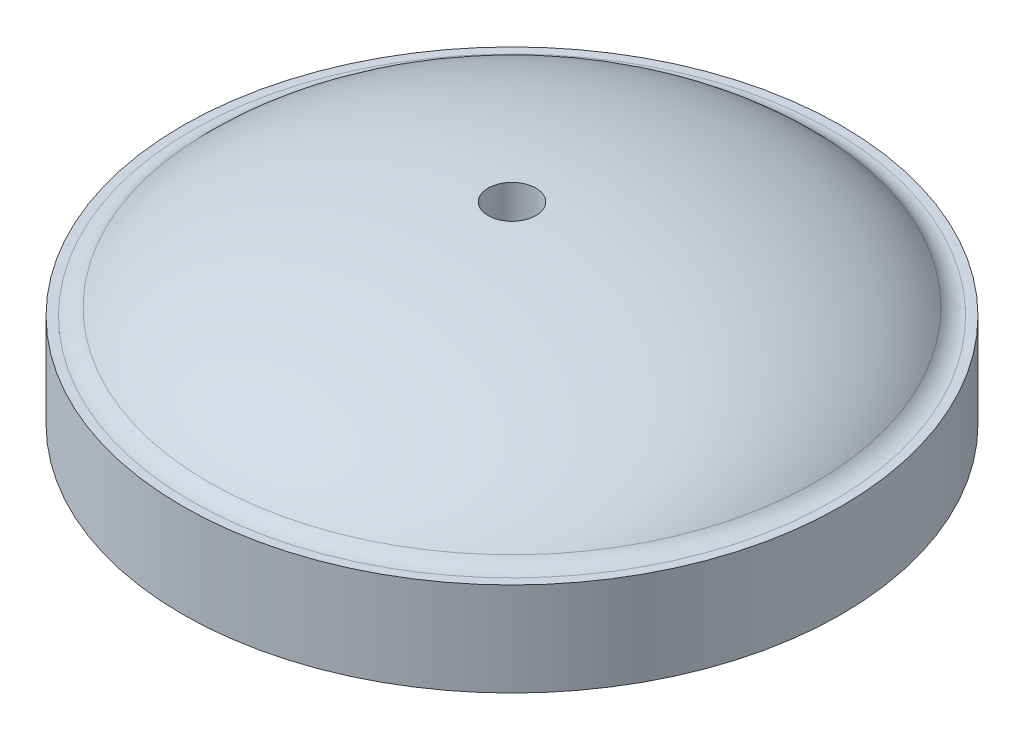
ISO-10303-21;
HEADER;
FILE_DESCRIPTION(('STEP AP214'),'2;1');
FILE_NAME('part.step','',(''),(''),'','','');
FILE_SCHEMA(('AUTOMOTIVE_DESIGN { 1 0 10303 214 1 1 1 1 }'));
ENDSEC;
DATA;
#1=APPLICATION_CONTEXT('core data for automotive mechanical design processes');
#2=APPLICATION_PROTOCOL_DEFINITION('international standard','automotive_design',2000,#1);
#3=PRODUCT_CONTEXT('',#1,'mechanical');
#4=PRODUCT('Part','Part','',(#3));
#5=PRODUCT_RELATED_PRODUCT_CATEGORY('part','',(#4));
#6=PRODUCT_DEFINITION_FORMATION('','',#4);
#7=PRODUCT_DEFINITION_CONTEXT('part definition',#1,'design');
#8=PRODUCT_DEFINITION('design','',#6,#7);
#9=PRODUCT_DEFINITION_SHAPE('','',#8);
#10=(LENGTH_UNIT() NAMED_UNIT(*) SI_UNIT(.MILLI.,.METRE.));
#11=(NAMED_UNIT(*) PLANE_ANGLE_UNIT() SI_UNIT($,.RADIAN.));
#12=(NAMED_UNIT(*) SI_UNIT($,.STERADIAN.) SOLID_ANGLE_UNIT());
#13=UNCERTAINTY_MEASURE_WITH_UNIT(LENGTH_MEASURE(1.E-05),#10,'distance_accuracy_value','');
#14=(GEOMETRIC_REPRESENTATION_CONTEXT(3) GLOBAL_UNCERTAINTY_ASSIGNED_CONTEXT((#13)) GLOBAL_UNIT_ASSIGNED_CONTEXT((#10,
#11,#12)) REPRESENTATION_CONTEXT('',''));
#15=CARTESIAN_POINT('',(0.,0.,0.));
#16=DIRECTION('',(0.,0.,1.));
#17=DIRECTION('',(1.,0.,0.));
#18=AXIS2_PLACEMENT_3D('',#15,#16,#17);
#19=CARTESIAN_POINT('',(0.,86.36,0.));
#20=DIRECTION('',(0.,1.,0.));
#21=DIRECTION('',(0.,0.,1.));
#22=AXIS2_PLACEMENT_3D('',#19,#20,#21);
#23=CYLINDRICAL_SURFACE('',#22,13.335);
#24=CARTESIAN_POINT('',(0.,5.99440000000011,0.));
#25=DIRECTION('',(0.,1.,0.));
#26=DIRECTION('',(0.,0.,1.));
#27=AXIS2_PLACEMENT_3D('',#24,#25,#26);
#28=CIRCLE('',#27,13.335);
#29=CARTESIAN_POINT('',(-5.24944570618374,5.99440000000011,12.2582847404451));
#30=VERTEX_POINT('',#29);
#31=CARTESIAN_POINT('',(0.937688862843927,5.99440000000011,13.3019910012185));
#32=VERTEX_POINT('',#31);
#33=EDGE_CURVE('E220',#30,#32,#28,.T.);
#34=ORIENTED_EDGE('',*,*,#33,.T.);
#35=DIRECTION('',(0.,-1.,0.));
#36=VECTOR('',#35,1.);
#37=CARTESIAN_POINT('',(0.937688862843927,39.9822405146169,13.3019910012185));
#38=LINE('',#37,#36);
#39=CARTESIAN_POINT('',(0.937688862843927,35.4691067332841,13.3019910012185));
#40=VERTEX_POINT('',#39);
#41=EDGE_CURVE('E205',#40,#32,#38,.T.);
#42=ORIENTED_EDGE('',*,*,#41,.F.);
#43=CARTESIAN_POINT('',(0.,35.4691067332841,0.));
#44=DIRECTION('',(0.,1.,0.));
#45=DIRECTION('',(0.,0.,1.));
#46=AXIS2_PLACEMENT_3D('',#43,#44,#45);
#47=CIRCLE('',#46,13.335);
#48=CARTESIAN_POINT('',(-5.24944570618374,35.4691067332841,12.2582847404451));
#49=VERTEX_POINT('',#48);
#50=EDGE_CURVE('E218',#49,#40,#47,.T.);
#51=ORIENTED_EDGE('',*,*,#50,.F.);
#52=DIRECTION('',(0.,-1.,0.));
#53=VECTOR('',#52,1.);
#54=CARTESIAN_POINT('',(-5.24944570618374,39.9812405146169,12.2582847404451));
#55=LINE('',#54,#53);
#56=EDGE_CURVE('E666',#49,#30,#55,.T.);
#57=ORIENTED_EDGE('',*,*,#56,.T.);
#58=EDGE_LOOP('',(#34,#42,#51,#57));
#59=FACE_BOUND('',#58,.T.);
#60=ADVANCED_FACE('F36',(#59),#23,.T.);
#61=CARTESIAN_POINT('',(0.,0.,0.));
#62=DIRECTION('',(0.,0.,-1.));
#63=DIRECTION('',(1.,0.,0.));
#64=AXIS2_PLACEMENT_3D('',#61,#62,#63);
#65=ELLIPSE('',#64,82.9945,35.936);
#66=TRIMMED_CURVE('',#65,(PARAMETER_VALUE(4.71238898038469)),
(PARAMETER_VALUE(7.85398163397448)),.T.,.PARAMETER.);
#67=CARTESIAN_POINT('',(0.,86.36,0.));
#68=DIRECTION('',(0.,1.,0.));
#69=AXIS1_PLACEMENT('',#67,#68);
#70=SURFACE_OF_REVOLUTION('',#66,#69);
#71=ORIENTED_EDGE('',*,*,#50,.T.);
#72=CARTESIAN_POINT('',(27.1896363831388,18.2466010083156,66.1284634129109));
#73=CARTESIAN_POINT('',(27.0742895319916,18.4365331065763,65.8963523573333));
#74=CARTESIAN_POINT('',(26.95809990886,18.6238602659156,65.6625454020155));
#75=CARTESIAN_POINT('',(26.724151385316,18.9934776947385,65.1917736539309));
#76=CARTESIAN_POINT('',(26.6063925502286,19.1757681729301,64.9548089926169));
#77=CARTESIAN_POINT('',(26.2515551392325,19.714406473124,64.2407740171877));
#78=CARTESIAN_POINT('',(26.0122982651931,20.063533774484,63.7593203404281));
#79=CARTESIAN_POINT('',(25.5291558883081,20.7431835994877,62.787098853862));
#80=CARTESIAN_POINT('',(25.285278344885,21.0737348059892,62.296347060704));
#81=CARTESIAN_POINT('',(24.7933681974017,21.7177115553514,61.3064822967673));
#82=CARTESIAN_POINT('',(24.5453392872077,22.0311513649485,60.8073767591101));
#83=CARTESIAN_POINT('',(24.0455485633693,22.642130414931,59.8016540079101));
#84=CARTESIAN_POINT('',(23.7937880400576,22.9396749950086,59.295039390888));
#85=CARTESIAN_POINT('',(23.2869047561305,23.5199045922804,58.2750443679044));
#86=CARTESIAN_POINT('',(23.0317820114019,23.8025896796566,57.7616639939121));
#87=CARTESIAN_POINT('',(22.5220238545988,24.3502126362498,56.735883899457));
#88=CARTESIAN_POINT('',(22.2674284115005,24.6153386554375,56.2235646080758));
#89=CARTESIAN_POINT('',(21.7555512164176,25.1327701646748,55.1935203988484));
#90=CARTESIAN_POINT('',(21.4982684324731,25.3850704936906,54.675793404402));
#91=CARTESIAN_POINT('',(20.9812845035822,25.8774899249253,53.6354729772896));
#92=CARTESIAN_POINT('',(20.7215824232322,26.1176040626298,53.1128776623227));
#93=CARTESIAN_POINT('',(20.2000136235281,26.5862093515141,52.0633311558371));
#94=CARTESIAN_POINT('',(19.9381462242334,26.8146966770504,51.5363785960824));
#95=CARTESIAN_POINT('',(19.4124882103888,27.2605413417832,50.4786034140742));
#96=CARTESIAN_POINT('',(19.1486972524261,27.4778966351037,49.9477801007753));
#97=CARTESIAN_POINT('',(18.6194265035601,27.9019115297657,48.8827350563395));
#98=CARTESIAN_POINT('',(18.3539467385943,28.1085712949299,48.3485133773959));
#99=CARTESIAN_POINT('',(17.6326223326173,28.6545825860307,46.897001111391));
#100=CARTESIAN_POINT('',(17.1752972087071,28.9840971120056,45.9767313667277));
#101=CARTESIAN_POINT('',(16.2569421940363,29.6150706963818,44.1287368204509));
#102=CARTESIAN_POINT('',(15.7959130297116,29.9165351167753,43.2010134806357));
#103=CARTESIAN_POINT('',(14.8705754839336,30.4931508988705,41.3389680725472));
#104=CARTESIAN_POINT('',(14.4062668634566,30.7683003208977,40.4046455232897));
#105=CARTESIAN_POINT('',(13.4747746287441,31.2937216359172,38.5302151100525));
#106=CARTESIAN_POINT('',(13.007590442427,31.5439883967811,37.5901060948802));
#107=CARTESIAN_POINT('',(12.0707219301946,32.020843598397,35.7048570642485));
#108=CARTESIAN_POINT('',(11.6010370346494,32.2474263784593,34.7597159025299));
#109=CARTESIAN_POINT('',(10.6595221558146,32.6779221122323,32.8651170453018));
#110=CARTESIAN_POINT('',(10.1876917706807,32.8818306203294,31.9156585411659));
#111=CARTESIAN_POINT('',(9.23091938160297,33.2724475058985,29.9903571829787));
#112=CARTESIAN_POINT('',(8.74593454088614,33.4586254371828,29.0144281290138));
#113=CARTESIAN_POINT('',(7.77441445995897,33.8088904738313,27.0594501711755));
#114=CARTESIAN_POINT('',(7.28787929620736,33.9729786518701,26.080401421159));
#115=CARTESIAN_POINT('',(6.3136209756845,34.2797174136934,24.1199133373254));
#116=CARTESIAN_POINT('',(5.82589821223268,34.4223743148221,23.1384747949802));
#117=CARTESIAN_POINT('',(4.84962235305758,34.6868070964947,21.1739268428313));
#118=CARTESIAN_POINT('',(4.36106990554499,34.8085950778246,20.1908187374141));
#119=CARTESIAN_POINT('',(3.38348902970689,35.0317726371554,18.2236447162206));
#120=CARTESIAN_POINT('',(2.89446142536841,35.1331804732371,17.2395804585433));
#121=CARTESIAN_POINT('',(1.91627788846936,35.315990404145,15.2711937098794));
#122=CARTESIAN_POINT('',(1.42712287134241,35.3974172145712,14.2868730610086));
#123=CARTESIAN_POINT('',(0.937688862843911,35.4691067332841,13.3019910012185));
#124=B_SPLINE_CURVE_WITH_KNOTS('',3,(#72,#73,#74,#75,#76,#77,#78,#79,#80,#81,#82,#83,#84,#85,
#86,#87,#88,#89,#90,#91,#92,#93,#94,#95,#96,#97,#98,#99,#100,#101,#102,#103,#104,#105,#106,#107,
#108,#109,#110,#111,#112,#113,#114,#115,#116,#117,#118,#119,#120,#121,#122,#123),.UNSPECIFIED.,
.F.,.F.,(4,2,2,2,2,2,2,2,2,2,2,2,2,2,2,2,2,2,2,2,2,2,2,2,2,4),(0.,0.963960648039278,
1.9278812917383,3.85057311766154,5.77020963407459,7.68822039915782,9.60558274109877,
11.5229360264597,13.4143895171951,15.3065981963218,17.1995716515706,19.0931639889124,
20.987103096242,22.8810131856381,26.1180777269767,29.3545222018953,32.5912050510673,
35.8285540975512,39.0666751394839,42.3054299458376,45.6219378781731,48.9382847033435,
52.2536520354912,55.5670904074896,58.8775469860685,62.1838878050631),.UNSPECIFIED.);
#125=CARTESIAN_POINT('',(24.223552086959,22.4242455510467,60.1598483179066));
#126=VERTEX_POINT('',#125);
#127=EDGE_CURVE('E202',#126,#40,#124,.T.);
#128=ORIENTED_EDGE('',*,*,#127,.F.);
#129=CARTESIAN_POINT('',(0.,22.4242455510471,0.));
#130=DIRECTION('',(0.,1.,0.));
#131=DIRECTION('',(0.,0.,1.));
#132=AXIS2_PLACEMENT_3D('',#129,#130,#131);
#133=CIRCLE('',#132,64.8535876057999);
#134=CARTESIAN_POINT('',(-42.6181887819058,22.4242455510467,48.884330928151));
#135=VERTEX_POINT('',#134);
#136=EDGE_CURVE('E235',#135,#126,#133,.T.);
#137=ORIENTED_EDGE('',*,*,#136,.F.);
#138=CARTESIAN_POINT('',(-5.24944570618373,35.4691067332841,12.2582847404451));
#139=CARTESIAN_POINT('',(-5.87554450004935,35.4119664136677,12.8719399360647));
#140=CARTESIAN_POINT('',(-6.50135708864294,35.3486319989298,13.4853146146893));
#141=CARTESIAN_POINT('',(-7.75246130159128,35.2093781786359,14.711553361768));
#142=CARTESIAN_POINT('',(-8.37775270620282,35.1334549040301,15.3244172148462));
#143=CARTESIAN_POINT('',(-9.62760840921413,34.9688446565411,16.549432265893));
#144=CARTESIAN_POINT('',(-10.2521725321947,34.8801550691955,17.1615832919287));
#145=CARTESIAN_POINT('',(-11.5003633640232,34.689794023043,18.3849665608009));
#146=CARTESIAN_POINT('',(-12.1239899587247,34.5881210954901,18.9961986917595));
#147=CARTESIAN_POINT('',(-13.3700933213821,34.3715434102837,20.2175359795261));
#148=CARTESIAN_POINT('',(-13.9925700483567,34.2566381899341,20.8276410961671));
#149=CARTESIAN_POINT('',(-15.2474711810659,34.0110935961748,22.0576012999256));
#150=CARTESIAN_POINT('',(-15.8798708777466,33.8802063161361,22.6774321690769));
#151=CARTESIAN_POINT('',(-17.1430333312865,33.604061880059,23.9154895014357));
#152=CARTESIAN_POINT('',(-17.7737961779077,33.4588055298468,24.5337160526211));
#153=CARTESIAN_POINT('',(-19.0334509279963,33.1535176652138,25.7683353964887));
#154=CARTESIAN_POINT('',(-19.6623429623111,32.9934872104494,26.3847283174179));
#155=CARTESIAN_POINT('',(-20.9180145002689,32.6581847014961,27.6154436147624));
#156=CARTESIAN_POINT('',(-21.5447941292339,32.4829135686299,28.2297661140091));
#157=CARTESIAN_POINT('',(-22.7959886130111,32.1165921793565,29.4560933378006));
#158=CARTESIAN_POINT('',(-23.4204035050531,31.9255421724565,30.0680980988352));
#159=CARTESIAN_POINT('',(-24.7292859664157,31.5069998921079,31.3509667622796));
#160=CARTESIAN_POINT('',(-25.4134717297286,31.2777751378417,32.021554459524));
#161=CARTESIAN_POINT('',(-26.7781593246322,30.7985428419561,33.3591191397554));
#162=CARTESIAN_POINT('',(-27.4586609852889,30.5485343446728,34.0260959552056));
#163=CARTESIAN_POINT('',(-28.8154672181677,30.0266499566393,35.3559359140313));
#164=CARTESIAN_POINT('',(-29.491771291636,29.7547715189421,36.0187985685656));
#165=CARTESIAN_POINT('',(-30.8396281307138,29.1878672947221,37.3398670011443));
#166=CARTESIAN_POINT('',(-31.5111795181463,28.8928350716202,37.9980714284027));
#167=CARTESIAN_POINT('',(-32.8489282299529,28.2780970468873,39.3092326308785));
#168=CARTESIAN_POINT('',(-33.5151223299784,27.9583774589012,39.9621862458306));
#169=CARTESIAN_POINT('',(-34.8350339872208,27.2956665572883,41.2558649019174));
#170=CARTESIAN_POINT('',(-35.4888096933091,26.9529028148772,41.8966469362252));
#171=CARTESIAN_POINT('',(-36.7887125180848,26.2397548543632,43.1707144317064));
#172=CARTESIAN_POINT('',(-37.4348390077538,25.8693683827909,43.803999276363));
#173=CARTESIAN_POINT('',(-38.7176899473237,25.0990035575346,45.061353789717));
#174=CARTESIAN_POINT('',(-39.3544187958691,24.6990396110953,45.6854277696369));
#175=CARTESIAN_POINT('',(-40.6165714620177,23.86713363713,46.9224953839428));
#176=CARTESIAN_POINT('',(-41.2420033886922,23.4352157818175,47.5354969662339));
#177=CARTESIAN_POINT('',(-42.4795379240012,22.5363922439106,48.7484357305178));
#178=CARTESIAN_POINT('',(-43.0916481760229,22.06950734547,49.3483804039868));
#179=CARTESIAN_POINT('',(-43.9069022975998,21.4134272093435,50.1474315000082));
#180=CARTESIAN_POINT('',(-44.1170466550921,21.2411722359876,50.3533992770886));
#181=CARTESIAN_POINT('',(-44.535243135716,20.8917748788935,50.7632841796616));
#182=CARTESIAN_POINT('',(-44.7432953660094,20.7146327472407,50.967201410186));
#183=CARTESIAN_POINT('',(-45.1571446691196,20.3552933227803,51.372825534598));
#184=CARTESIAN_POINT('',(-45.3629418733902,20.17309632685,51.5745325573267));
#185=CARTESIAN_POINT('',(-45.7726299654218,19.8029900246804,51.976078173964));
#186=CARTESIAN_POINT('',(-45.976514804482,19.6150675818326,52.1759108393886));
#187=CARTESIAN_POINT('',(-46.3816748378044,19.2337388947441,52.5730183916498));
#188=CARTESIAN_POINT('',(-46.5829498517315,19.0403322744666,52.7702931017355));
#189=CARTESIAN_POINT('',(-46.9826976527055,18.6477994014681,53.1620959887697));
#190=CARTESIAN_POINT('',(-47.1811698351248,18.4486719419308,53.3566235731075));
#191=CARTESIAN_POINT('',(-47.3781086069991,18.2466010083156,53.5496482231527));
#192=B_SPLINE_CURVE_WITH_KNOTS('',3,(#138,#139,#140,#141,#142,#143,#144,#145,#146,#147,#148,
#149,#150,#151,#152,#153,#154,#155,#156,#157,#158,#159,#160,#161,#162,#163,#164,#165,#166,#167,
#168,#169,#170,#171,#172,#173,#174,#175,#176,#177,#178,#179,#180,#181,#182,#183,#184,#185,#186,
#187,#188,#189,#190,#191),.UNSPECIFIED.,.F.,.F.,(4,2,2,2,2,2,2,2,2,2,2,2,2,2,2,2,2,2,2,2,2,2,2,
2,2,2,4),(0.,2.63561075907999,5.27203305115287,7.90899603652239,10.5462575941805,
13.1836113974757,15.868875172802,18.5539884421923,21.2389092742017,23.9236679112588,
26.6083841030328,29.5633382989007,32.5184284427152,35.4738632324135,38.4301225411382,
41.3880448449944,44.320140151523,47.2524749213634,50.1833906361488,53.1121114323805,
56.0391050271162,57.0619567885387,58.084755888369,59.1074950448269,60.1327898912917,
61.1581552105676,62.1837384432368),.UNSPECIFIED.);
#193=EDGE_CURVE('E225',#49,#135,#192,.T.);
#194=ORIENTED_EDGE('',*,*,#193,.F.);
#195=EDGE_LOOP('',(#71,#128,#137,#194));
#196=FACE_BOUND('',#195,.T.);
#197=ADVANCED_FACE('F224',(#196),#70,.T.);
#198=CARTESIAN_POINT('',(0.,11.2598343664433,0.));
#199=DIRECTION('',(0.,1.,0.));
#200=DIRECTION('',(0.,0.,1.));
#201=AXIS2_PLACEMENT_3D('',#198,#199,#200);
#202=TOROIDAL_SURFACE('',#201,58.7999999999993,12.7000000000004);
#203=ORIENTED_EDGE('',*,*,#136,.T.);
#204=CARTESIAN_POINT('',(24.2233874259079,22.4244455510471,60.1595169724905));
#205=CARTESIAN_POINT('',(24.363440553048,22.2543851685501,60.4413441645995));
#206=CARTESIAN_POINT('',(24.5002898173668,22.0710123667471,60.7167242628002));
#207=CARTESIAN_POINT('',(24.7666401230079,21.6790720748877,61.2526977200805));
#208=CARTESIAN_POINT('',(24.8961413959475,21.4705053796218,61.5132915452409));
#209=CARTESIAN_POINT('',(25.1467394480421,21.0298158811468,62.0175669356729));
#210=CARTESIAN_POINT('',(25.2678444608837,20.7977167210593,62.2612650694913));
#211=CARTESIAN_POINT('',(25.5009259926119,20.3114353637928,62.7302921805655));
#212=CARTESIAN_POINT('',(25.6129026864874,20.0572535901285,62.9556215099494));
#213=CARTESIAN_POINT('',(25.8269745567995,19.5284743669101,63.3863957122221));
#214=CARTESIAN_POINT('',(25.9290653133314,19.2538678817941,63.591831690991));
#215=CARTESIAN_POINT('',(26.1225770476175,18.6862774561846,63.981232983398));
#216=CARTESIAN_POINT('',(26.2139978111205,18.39329314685,64.165197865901));
#217=CARTESIAN_POINT('',(26.3855392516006,17.7909238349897,64.5103886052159));
#218=CARTESIAN_POINT('',(26.4656558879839,17.481533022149,64.6716063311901));
#219=CARTESIAN_POINT('',(26.6139686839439,16.8486625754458,64.9700543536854));
#220=CARTESIAN_POINT('',(26.6821653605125,16.5251835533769,65.1072856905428));
#221=CARTESIAN_POINT('',(26.8060818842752,15.8667917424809,65.356641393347));
#222=CARTESIAN_POINT('',(26.8618152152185,15.5318917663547,65.4687928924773));
#223=CARTESIAN_POINT('',(26.9604952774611,14.8527188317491,65.6673655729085));
#224=CARTESIAN_POINT('',(27.0034424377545,14.5084461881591,65.753787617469));
#225=CARTESIAN_POINT('',(27.0761827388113,13.8135604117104,65.9001620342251));
#226=CARTESIAN_POINT('',(27.1059971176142,13.4629584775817,65.9601571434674));
#227=CARTESIAN_POINT('',(27.1523454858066,12.7575031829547,66.0534233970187));
#228=CARTESIAN_POINT('',(27.1688873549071,12.4026524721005,66.0867103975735));
#229=CARTESIAN_POINT('',(27.1823765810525,11.9158320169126,66.1138546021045));
#230=CARTESIAN_POINT('',(27.1851013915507,11.784574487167,66.1193377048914));
#231=CARTESIAN_POINT('',(27.1887304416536,11.5220942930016,66.1266403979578));
#232=CARTESIAN_POINT('',(27.1896369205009,11.3908717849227,66.1284644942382));
#233=CARTESIAN_POINT('',(27.189636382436,11.2596343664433,66.1284634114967));
#234=B_SPLINE_CURVE_WITH_KNOTS('',3,(#204,#205,#206,#207,#208,#209,#210,#211,#212,#213,#214,
#215,#216,#217,#218,#219,#220,#221,#222,#223,#224,#225,#226,#227,#228,#229,#230,#231,#232,#233),
.UNSPECIFIED.,.F.,.F.,(4,2,2,2,2,2,2,2,2,2,2,2,2,2,4),(0.,1.07283030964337,2.14562678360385,
3.21735590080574,4.28906446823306,5.36124999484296,6.43345704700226,7.50604638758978,
8.57858919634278,9.64996597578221,10.7213068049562,11.7909086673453,12.8598750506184,
13.2540272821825,13.6476938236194),.UNSPECIFIED.);
#235=CARTESIAN_POINT('',(27.1896363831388,11.2598343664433,66.1284634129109));
#236=VERTEX_POINT('',#235);
#237=EDGE_CURVE('E208',#126,#236,#234,.T.);
#238=ORIENTED_EDGE('',*,*,#237,.T.);
#239=CARTESIAN_POINT('',(0.,11.2598343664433,0.));
#240=DIRECTION('',(0.,1.,0.));
#241=DIRECTION('',(0.,0.,1.));
#242=AXIS2_PLACEMENT_3D('',#239,#240,#241);
#243=CIRCLE('',#242,71.5);
#244=CARTESIAN_POINT('',(-47.3781086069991,11.2598343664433,53.5496482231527));
#245=VERTEX_POINT('',#244);
#246=EDGE_CURVE('E248',#245,#236,#243,.T.);
#247=ORIENTED_EDGE('',*,*,#246,.F.);
#248=CARTESIAN_POINT('',(-47.3781086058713,11.2596343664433,53.5496482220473));
#249=CARTESIAN_POINT('',(-47.3781404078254,11.6162012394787,53.5496793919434));
#250=CARTESIAN_POINT('',(-47.3673663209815,11.9727626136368,53.5391194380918));
#251=CARTESIAN_POINT('',(-47.3244070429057,12.6833301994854,53.4970139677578));
#252=CARTESIAN_POINT('',(-47.2922229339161,13.0373365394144,53.4654695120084));
#253=CARTESIAN_POINT('',(-47.2066932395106,13.7398840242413,53.3816397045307));
#254=CARTESIAN_POINT('',(-47.1533719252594,14.0884309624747,53.3293781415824));
#255=CARTESIAN_POINT('',(-47.0259604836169,14.7779950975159,53.2044989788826));
#256=CARTESIAN_POINT('',(-46.9518706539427,15.1190124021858,53.1318816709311));
#257=CARTESIAN_POINT('',(-46.7834225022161,15.7912203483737,52.9667813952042));
#258=CARTESIAN_POINT('',(-46.6890571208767,16.1224075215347,52.8742915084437));
#259=CARTESIAN_POINT('',(-46.4807492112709,16.7724908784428,52.6701236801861));
#260=CARTESIAN_POINT('',(-46.3668062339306,17.0913867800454,52.5584452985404));
#261=CARTESIAN_POINT('',(-46.1201140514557,17.7147438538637,52.3166560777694));
#262=CARTESIAN_POINT('',(-45.9873575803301,18.0191993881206,52.1865381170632));
#263=CARTESIAN_POINT('',(-45.7040288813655,18.6113803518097,51.908840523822));
#264=CARTESIAN_POINT('',(-45.5534573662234,18.8991064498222,51.761261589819));
#265=CARTESIAN_POINT('',(-45.2352890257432,19.4563093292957,51.4494167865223));
#266=CARTESIAN_POINT('',(-45.0676623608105,19.7257527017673,51.2851216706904));
#267=CARTESIAN_POINT('',(-44.7168103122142,20.2439216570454,50.9412427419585));
#268=CARTESIAN_POINT('',(-44.5335853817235,20.4926478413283,50.7616593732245));
#269=CARTESIAN_POINT('',(-44.1531543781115,20.9672591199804,50.3887893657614));
#270=CARTESIAN_POINT('',(-43.9559707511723,21.1931795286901,50.1955247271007));
#271=CARTESIAN_POINT('',(-43.5488430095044,21.6209580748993,49.796488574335));
#272=CARTESIAN_POINT('',(-43.3389063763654,21.8228301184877,49.5907243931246));
#273=CARTESIAN_POINT('',(-43.0406741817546,22.0845444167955,49.2984195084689));
#274=CARTESIAN_POINT('',(-42.9571582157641,22.1552374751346,49.2165634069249));
#275=CARTESIAN_POINT('',(-42.7886529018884,22.292738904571,49.0514071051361));
#276=CARTESIAN_POINT('',(-42.7036655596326,22.3595520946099,48.968108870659));
#277=CARTESIAN_POINT('',(-42.617924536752,22.4244455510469,48.8840719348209));
#278=B_SPLINE_CURVE_WITH_KNOTS('',3,(#248,#249,#250,#251,#252,#253,#254,#255,#256,#257,#258,
#259,#260,#261,#262,#263,#264,#265,#266,#267,#268,#269,#270,#271,#272,#273,#274,#275,#276,#277),
.UNSPECIFIED.,.F.,.F.,(4,2,2,2,2,2,2,2,2,2,2,2,2,2,4),(0.,1.06937326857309,2.13869248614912,
3.20678737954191,4.27486696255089,5.34331902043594,6.41179558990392,7.48068594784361,
8.54953355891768,9.62028447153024,10.6910042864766,11.7600398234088,12.8284541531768,
13.2383450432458,13.647715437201),.UNSPECIFIED.);
#279=EDGE_CURVE('E653',#245,#135,#278,.T.);
#280=ORIENTED_EDGE('',*,*,#279,.T.);
#281=EDGE_LOOP('',(#203,#238,#247,#280));
#282=FACE_BOUND('',#281,.T.);
#283=ADVANCED_FACE('F335',(#282),#202,.F.);
#284=CARTESIAN_POINT('',(0.,86.36,0.));
#285=DIRECTION('',(0.,1.,0.));
#286=DIRECTION('',(0.,0.,1.));
#287=AXIS2_PLACEMENT_3D('',#284,#285,#286);
#288=CYLINDRICAL_SURFACE('',#287,71.5);
#289=ORIENTED_EDGE('',*,*,#246,.T.);
#290=DIRECTION('',(0.,-1.,0.));
#291=VECTOR('',#290,1.);
#292=CARTESIAN_POINT('',(27.1896363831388,39.9822405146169,66.1284634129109));
#293=LINE('',#292,#291);
#294=CARTESIAN_POINT('',(27.1896363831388,5.99440000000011,66.1284634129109));
#295=VERTEX_POINT('',#294);
#296=EDGE_CURVE('E606',#236,#295,#293,.T.);
#297=ORIENTED_EDGE('',*,*,#296,.T.);
#298=CARTESIAN_POINT('',(0.,5.99440000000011,0.));
#299=DIRECTION('',(0.,1.,0.));
#300=DIRECTION('',(0.,0.,1.));
#301=AXIS2_PLACEMENT_3D('',#298,#299,#300);
#302=CIRCLE('',#301,71.5);
#303=CARTESIAN_POINT('',(-47.3781086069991,5.99440000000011,53.5496482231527));
#304=VERTEX_POINT('',#303);
#305=EDGE_CURVE('E264',#304,#295,#302,.T.);
#306=ORIENTED_EDGE('',*,*,#305,.F.);
#307=DIRECTION('',(0.,-1.,0.));
#308=VECTOR('',#307,1.);
#309=CARTESIAN_POINT('',(-47.3781086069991,39.9812405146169,53.5496482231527));
#310=LINE('',#309,#308);
#311=EDGE_CURVE('E677',#245,#304,#310,.T.);
#312=ORIENTED_EDGE('',*,*,#311,.F.);
#313=EDGE_LOOP('',(#289,#297,#306,#312));
#314=FACE_BOUND('',#313,.T.);
#315=ADVANCED_FACE('F338',(#314),#288,.F.);
#316=CARTESIAN_POINT('',(10.0361536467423,35.4691067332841,8.7805378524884));
#317=VERTEX_POINT('',#316);
#318=CARTESIAN_POINT('',(12.9407070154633,35.4691067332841,3.218746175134));
#319=VERTEX_POINT('',#318);
#320=EDGE_CURVE('E227',#317,#319,#47,.T.);
#321=ORIENTED_EDGE('',*,*,#320,.F.);
#322=DIRECTION('',(0.,-1.,0.));
#323=VECTOR('',#322,1.);
#324=CARTESIAN_POINT('',(10.0361536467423,39.9822405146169,8.78053785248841));
#325=LINE('',#324,#323);
#326=CARTESIAN_POINT('',(10.0361536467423,5.99440000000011,8.78053785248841));
#327=VERTEX_POINT('',#326);
#328=EDGE_CURVE('E221',#317,#327,#325,.T.);
#329=ORIENTED_EDGE('',*,*,#328,.T.);
#330=CARTESIAN_POINT('',(12.9407070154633,5.99440000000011,3.218746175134));
#331=VERTEX_POINT('',#330);
#332=EDGE_CURVE('E553',#327,#331,#28,.T.);
#333=ORIENTED_EDGE('',*,*,#332,.T.);
#334=DIRECTION('',(0.,-1.,0.));
#335=VECTOR('',#334,1.);
#336=CARTESIAN_POINT('',(12.9407070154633,39.9822405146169,3.218746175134));
#337=LINE('',#336,#335);
#338=EDGE_CURVE('E524',#319,#331,#337,.T.);
#339=ORIENTED_EDGE('',*,*,#338,.F.);
#340=EDGE_LOOP('',(#321,#329,#333,#339));
#341=FACE_BOUND('',#340,.T.);
#342=ADVANCED_FACE('F331',(#341),#23,.T.);
#343=CARTESIAN_POINT('',(33.3220168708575,22.4242455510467,55.6383951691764));
#344=VERTEX_POINT('',#343);
#345=CARTESIAN_POINT('',(64.7009050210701,22.4242455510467,-4.4475515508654));
#346=VERTEX_POINT('',#345);
#347=EDGE_CURVE('E241',#344,#346,#133,.T.);
#348=ORIENTED_EDGE('',*,*,#347,.F.);
#349=CARTESIAN_POINT('',(10.0361536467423,35.4691067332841,8.78053785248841));
#350=CARTESIAN_POINT('',(10.4262992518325,35.4119664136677,9.56562307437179));
#351=CARTESIAN_POINT('',(10.8162665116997,35.3486319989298,10.3503494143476));
#352=CARTESIAN_POINT('',(11.5958763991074,35.2093781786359,11.9191488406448));
#353=CARTESIAN_POINT('',(11.9855188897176,35.1334549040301,12.7032216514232));
#354=CARTESIAN_POINT('',(12.7643507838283,34.9688446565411,14.2704555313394));
#355=CARTESIAN_POINT('',(13.1535400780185,34.8801550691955,15.0536163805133));
#356=CARTESIAN_POINT('',(13.9313345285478,34.689794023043,16.6187626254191));
#357=CARTESIAN_POINT('',(14.3199396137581,34.5881210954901,17.4007478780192));
#358=CARTESIAN_POINT('',(15.0964332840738,34.3715434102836,18.9632765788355));
#359=CARTESIAN_POINT('',(15.4843218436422,34.2566381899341,19.743819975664));
#360=CARTESIAN_POINT('',(16.2662977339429,34.0110935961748,21.3173804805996));
#361=CARTESIAN_POINT('',(16.6603696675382,33.8802063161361,22.1103666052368));
#362=CARTESIAN_POINT('',(17.4474934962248,33.604061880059,23.6942862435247));
#363=CARTESIAN_POINT('',(17.8405454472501,33.4588055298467,24.4852198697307));
#364=CARTESIAN_POINT('',(18.625483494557,33.1535176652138,26.0647410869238));
#365=CARTESIAN_POINT('',(19.0173696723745,32.9934872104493,26.8533288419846));
#366=CARTESIAN_POINT('',(19.7998256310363,32.658184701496,28.4278553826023));
#367=CARTESIAN_POINT('',(20.1903954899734,32.4829135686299,29.2137943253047));
#368=CARTESIAN_POINT('',(20.970061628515,32.1165921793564,30.7827069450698));
#369=CARTESIAN_POINT('',(21.3591579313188,31.9255421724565,31.5656806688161));
#370=CARTESIAN_POINT('',(22.1747716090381,31.5069998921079,33.206930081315));
#371=CARTESIAN_POINT('',(22.6011133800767,31.2777751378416,34.0648524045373));
#372=CARTESIAN_POINT('',(23.4515013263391,30.7985428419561,35.7760776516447));
#373=CARTESIAN_POINT('',(23.8755473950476,30.5485343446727,36.6293803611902));
#374=CARTESIAN_POINT('',(24.721024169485,30.0266499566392,38.3307229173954));
#375=CARTESIAN_POINT('',(25.1424545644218,29.7547715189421,39.178762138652));
#376=CARTESIAN_POINT('',(25.982354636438,29.1878672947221,40.8688827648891));
#377=CARTESIAN_POINT('',(26.4008234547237,28.8928350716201,41.7109624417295));
#378=CARTESIAN_POINT('',(27.2344247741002,28.2780970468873,43.3884081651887));
#379=CARTESIAN_POINT('',(27.6495552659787,27.9583774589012,44.223770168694));
#380=CARTESIAN_POINT('',(28.4720416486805,27.2956665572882,45.8788494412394));
#381=CARTESIAN_POINT('',(28.879433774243,26.9529028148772,46.6986396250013));
#382=CARTESIAN_POINT('',(29.6894519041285,26.2397548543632,48.3286291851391));
#383=CARTESIAN_POINT('',(30.0920775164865,25.8693683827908,49.1388277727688));
#384=CARTESIAN_POINT('',(30.8914699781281,25.0990035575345,50.7474354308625));
#385=CARTESIAN_POINT('',(31.2882395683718,24.6990396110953,51.5458500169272));
#386=CARTESIAN_POINT('',(32.0747341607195,23.8671336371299,53.1285034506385));
#387=CARTESIAN_POINT('',(32.4644642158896,23.4352157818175,53.912752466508));
#388=CARTESIAN_POINT('',(33.2356183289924,22.5363922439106,55.4645364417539));
#389=CARTESIAN_POINT('',(33.6170471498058,22.06950734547,56.2320809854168));
#390=CARTESIAN_POINT('',(34.1250625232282,21.4134272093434,57.2543540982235));
#391=CARTESIAN_POINT('',(34.2560113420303,21.2411722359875,57.5178608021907));
#392=CARTESIAN_POINT('',(34.5166052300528,20.8917748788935,58.0422506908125));
#393=CARTESIAN_POINT('',(34.6462503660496,20.7146327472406,58.3031340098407));
#394=CARTESIAN_POINT('',(34.9041353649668,20.3552933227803,58.8220728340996));
#395=CARTESIAN_POINT('',(35.0323753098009,20.17309632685,59.0801285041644));
#396=CARTESIAN_POINT('',(35.2876673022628,19.8029900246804,59.5938494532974));
#397=CARTESIAN_POINT('',(35.4147155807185,19.6150675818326,59.8495071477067));
#398=CARTESIAN_POINT('',(35.6671859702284,19.2337388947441,60.3575502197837));
#399=CARTESIAN_POINT('',(35.7926079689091,19.0403322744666,60.6099353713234));
#400=CARTESIAN_POINT('',(36.0417057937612,18.6477994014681,61.1111918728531));
#401=CARTESIAN_POINT('',(36.1653812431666,18.4486719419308,61.3600624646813));
#402=CARTESIAN_POINT('',(36.2881011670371,18.2466010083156,61.6070102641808));
#403=B_SPLINE_CURVE_WITH_KNOTS('',3,(#349,#350,#351,#352,#353,#354,#355,#356,#357,#358,#359,
#360,#361,#362,#363,#364,#365,#366,#367,#368,#369,#370,#371,#372,#373,#374,#375,#376,#377,#378,
#379,#380,#381,#382,#383,#384,#385,#386,#387,#388,#389,#390,#391,#392,#393,#394,#395,#396,#397,
#398,#399,#400,#401,#402),.UNSPECIFIED.,.F.,.F.,(4,2,2,2,2,2,2,2,2,2,2,2,2,2,2,2,2,2,2,2,2,2,2,
2,2,2,4),(0.,2.63561075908,5.27203305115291,7.90899603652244,10.5462575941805,13.1836113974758,
15.8688751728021,18.5539884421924,21.2389092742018,23.923667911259,26.608384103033,
29.5633382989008,32.5184284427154,35.4738632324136,38.4301225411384,41.3880448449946,
44.3201401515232,47.2524749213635,50.1833906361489,53.1121114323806,56.0391050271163,
57.0619567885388,58.084755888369,59.1074950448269,60.1327898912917,61.1581552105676,
62.1837384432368),.UNSPECIFIED.);
#404=EDGE_CURVE('E599',#317,#344,#403,.T.);
#405=ORIENTED_EDGE('',*,*,#404,.F.);
#406=ORIENTED_EDGE('',*,*,#320,.T.);
#407=CARTESIAN_POINT('',(71.2939657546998,18.2466010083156,-5.42406185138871));
#408=CARTESIAN_POINT('',(71.0375708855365,18.4365331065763,-5.38608673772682));
#409=CARTESIAN_POINT('',(70.7793026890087,18.6238602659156,-5.34783416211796));
#410=CARTESIAN_POINT('',(70.2592780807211,18.9934776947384,-5.27081236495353));
#411=CARTESIAN_POINT('',(69.997521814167,19.1757681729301,-5.23204316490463));
#412=CARTESIAN_POINT('',(69.2087834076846,19.714406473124,-5.1152216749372));
#413=CARTESIAN_POINT('',(68.6769593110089,20.063533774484,-5.0364522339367));
#414=CARTESIAN_POINT('',(67.6030225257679,20.7431835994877,-4.87738948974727));
#415=CARTESIAN_POINT('',(67.0609275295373,21.0737348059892,-4.79709880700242));
#416=CARTESIAN_POINT('',(65.9675016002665,21.7177115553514,-4.63514948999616));
#417=CARTESIAN_POINT('',(65.4161788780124,22.0311513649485,-4.55349207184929));
#418=CARTESIAN_POINT('',(64.3052358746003,22.642130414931,-4.38894826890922));
#419=CARTESIAN_POINT('',(63.745618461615,22.9396749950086,-4.30606230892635));
#420=CARTESIAN_POINT('',(62.6189099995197,23.5199045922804,-4.13918345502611));
#421=CARTESIAN_POINT('',(62.0518189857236,23.8025896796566,-4.05519056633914));
#422=CARTESIAN_POINT('',(60.9187202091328,24.3502126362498,-3.88736523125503));
#423=CARTESIAN_POINT('',(60.3528012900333,24.6153386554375,-3.80354594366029));
#424=CARTESIAN_POINT('',(59.2149922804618,25.1327701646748,-3.63502296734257));
#425=CARTESIAN_POINT('',(58.6430998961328,25.3850704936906,-3.55031893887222));
#426=CARTESIAN_POINT('',(57.4939395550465,25.8774899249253,-3.38011469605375));
#427=CARTESIAN_POINT('',(56.9166695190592,26.1176040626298,-3.29461417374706));
#428=CARTESIAN_POINT('',(55.757317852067,26.5862093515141,-3.12290047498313));
#429=CARTESIAN_POINT('',(55.1752347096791,26.8146966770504,-3.03668707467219));
#430=CARTESIAN_POINT('',(54.0067934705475,27.2605413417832,-2.86362710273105));
#431=CARTESIAN_POINT('',(53.4204346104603,27.4778966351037,-2.77678041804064));
#432=CARTESIAN_POINT('',(52.2439629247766,27.9019115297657,-2.6025310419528));
#433=CARTESIAN_POINT('',(51.653850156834,28.1085712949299,-2.5151283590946));
#434=CARTESIAN_POINT('',(50.0504784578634,28.6545825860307,-2.27765004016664));
#435=CARTESIAN_POINT('',(49.0339286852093,28.9840971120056,-2.12708699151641));
#436=CARTESIAN_POINT('',(46.9925941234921,29.6150706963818,-1.82474119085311));
#437=CARTESIAN_POINT('',(45.9678109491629,29.9165351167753,-1.67295867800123));
#438=CARTESIAN_POINT('',(43.9109555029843,30.4931508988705,-1.36831405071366));
#439=CARTESIAN_POINT('',(42.8788826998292,30.7683003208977,-1.21545185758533));
#440=CARTESIAN_POINT('',(40.8083465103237,31.2937216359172,-0.90878095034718));
#441=CARTESIAN_POINT('',(39.7698818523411,31.5439883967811,-0.754972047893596));
#442=CARTESIAN_POINT('',(37.6873951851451,32.020843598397,-0.446531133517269));
#443=CARTESIAN_POINT('',(36.6433719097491,32.2474263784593,-0.291898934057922));
#444=CARTESIAN_POINT('',(34.5505572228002,32.6779221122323,0.0180716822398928));
#445=CARTESIAN_POINT('',(33.5017649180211,32.8818306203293,0.17341023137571));
#446=CARTESIAN_POINT('',(31.3750355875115,33.2724475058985,0.488404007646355));
#447=CARTESIAN_POINT('',(30.2970033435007,33.4586254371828,0.648073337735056));
#448=CARTESIAN_POINT('',(28.1374926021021,33.8088904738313,0.967922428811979));
#449=CARTESIAN_POINT('',(27.0560142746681,33.97297865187,1.12810216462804));
#450=CARTESIAN_POINT('',(24.8904169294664,34.2797174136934,1.44885275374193));
#451=CARTESIAN_POINT('',(23.8062987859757,34.4223743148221,1.60942347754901));
#452=CARTESIAN_POINT('',(21.6362168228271,34.6868070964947,1.93083829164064));
#453=CARTESIAN_POINT('',(20.5502544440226,34.8085950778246,2.09168216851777));
#454=CARTESIAN_POINT('',(18.3772716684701,35.0317726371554,2.41352662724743));
#455=CARTESIAN_POINT('',(17.2902531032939,35.1331804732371,2.57452693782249));
#456=CARTESIAN_POINT('',(15.1159307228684,35.315990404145,2.89656980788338));
#457=CARTESIAN_POINT('',(14.02862894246,35.3974172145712,3.0576120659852));
#458=CARTESIAN_POINT('',(12.9407070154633,35.4691067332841,3.21874617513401));
#459=B_SPLINE_CURVE_WITH_KNOTS('',3,(#407,#408,#409,#410,#411,#412,#413,#414,#415,#416,#417,
#418,#419,#420,#421,#422,#423,#424,#425,#426,#427,#428,#429,#430,#431,#432,#433,#434,#435,#436,
#437,#438,#439,#440,#441,#442,#443,#444,#445,#446,#447,#448,#449,#450,#451,#452,#453,#454,#455,
#456,#457,#458),.UNSPECIFIED.,.F.,.F.,(4,2,2,2,2,2,2,2,2,2,2,2,2,2,2,2,2,2,2,2,2,2,2,2,2,4),(0.,
0.963960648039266,1.92788129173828,3.85057311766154,5.7702096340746,7.68822039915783,
9.60558274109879,11.5229360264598,13.4143895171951,15.3065981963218,17.1995716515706,
19.0931639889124,20.987103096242,22.8810131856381,26.1180777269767,29.3545222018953,
32.5912050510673,35.8285540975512,39.0666751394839,42.3054299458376,45.6219378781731,
48.9382847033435,52.2536520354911,55.5670904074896,58.8775469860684,62.183887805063),.UNSPECIFIED.);
#460=EDGE_CURVE('E517',#346,#319,#459,.T.);
#461=ORIENTED_EDGE('',*,*,#460,.F.);
#462=EDGE_LOOP('',(#348,#405,#406,#461));
#463=FACE_BOUND('',#462,.T.);
#464=ADVANCED_FACE('F336',(#463),#70,.T.);
#465=CARTESIAN_POINT('',(36.2881011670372,11.2598343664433,61.6070102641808));
#466=VERTEX_POINT('',#465);
#467=CARTESIAN_POINT('',(71.2939657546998,11.2598343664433,-5.42406185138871));
#468=VERTEX_POINT('',#467);
#469=EDGE_CURVE('E255',#466,#468,#243,.T.);
#470=ORIENTED_EDGE('',*,*,#469,.F.);
#471=CARTESIAN_POINT('',(36.1810071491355,8.80233098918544,61.3915062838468));
#472=CARTESIAN_POINT('',(36.1987832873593,9.004344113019,61.4272769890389));
#473=CARTESIAN_POINT('',(36.2143649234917,9.20729473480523,61.4586317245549));
#474=CARTESIAN_POINT('',(36.2411097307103,9.61466402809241,61.5124499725));
#475=CARTESIAN_POINT('',(36.2522728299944,9.8190827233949,61.5349133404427));
#476=CARTESIAN_POINT('',(36.2791152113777,10.4345130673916,61.5889279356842));
#477=CARTESIAN_POINT('',(36.2880959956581,10.847112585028,61.6069998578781));
#478=CARTESIAN_POINT('',(36.2881056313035,11.615854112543,61.6070192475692));
#479=CARTESIAN_POINT('',(36.2814173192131,11.9720158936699,61.5935604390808));
#480=CARTESIAN_POINT('',(36.2547079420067,12.6819435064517,61.5398134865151));
#481=CARTESIAN_POINT('',(36.2346829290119,13.0357085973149,61.4995173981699));
#482=CARTESIAN_POINT('',(36.1814262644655,13.7383367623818,61.3923496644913));
#483=CARTESIAN_POINT('',(36.1481887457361,14.0871975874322,61.325466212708));
#484=CARTESIAN_POINT('',(36.0687472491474,14.7773852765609,61.1656070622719));
#485=CARTESIAN_POINT('',(36.0225432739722,15.1187121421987,61.0726313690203));
#486=CARTESIAN_POINT('',(35.9175326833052,15.7912027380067,60.861319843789));
#487=CARTESIAN_POINT('',(35.8587336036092,16.1223724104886,60.7429991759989));
#488=CARTESIAN_POINT('',(35.7289371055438,16.7724237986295,60.4818112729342));
#489=CARTESIAN_POINT('',(35.6579393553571,17.0913051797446,60.3389433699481));
#490=CARTESIAN_POINT('',(35.5042184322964,17.7146658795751,60.029612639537));
#491=CARTESIAN_POINT('',(35.4214895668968,18.0191381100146,59.8631383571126));
#492=CARTESIAN_POINT('',(35.2449289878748,18.6113509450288,59.5078476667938));
#493=CARTESIAN_POINT('',(35.1510977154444,18.899092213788,59.3190321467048));
#494=CARTESIAN_POINT('',(34.9527996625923,19.456394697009,58.9199994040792));
#495=CARTESIAN_POINT('',(34.8483116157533,19.7259177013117,58.7097393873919));
#496=CARTESIAN_POINT('',(34.6296074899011,20.2442378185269,58.2696437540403));
#497=CARTESIAN_POINT('',(34.5153915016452,20.4930351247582,58.039808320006));
#498=CARTESIAN_POINT('',(34.2783181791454,20.9676205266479,57.5627485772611));
#499=CARTESIAN_POINT('',(34.1554805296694,21.1934583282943,57.3155638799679));
#500=CARTESIAN_POINT('',(33.9018593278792,21.6210863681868,56.8052050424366));
#501=CARTESIAN_POINT('',(33.7710804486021,21.8228905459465,56.5420403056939));
#502=CARTESIAN_POINT('',(33.5853209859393,22.0844912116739,56.16823881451));
#503=CARTESIAN_POINT('',(33.5333174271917,22.1551337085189,56.0635926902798));
#504=CARTESIAN_POINT('',(33.4283171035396,22.2926414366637,55.8523018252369));
#505=CARTESIAN_POINT('',(33.3753201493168,22.359505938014,55.7456567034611));
#506=CARTESIAN_POINT('',(33.1814364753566,22.5949878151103,55.3555069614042));
#507=CARTESIAN_POINT('',(33.0377724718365,22.7522546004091,55.0664136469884));
#508=CARTESIAN_POINT('',(32.7449772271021,23.0391000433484,54.4772253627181));
#509=CARTESIAN_POINT('',(32.5958422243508,23.1686592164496,54.1771228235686));
#510=CARTESIAN_POINT('',(32.2931234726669,23.3991765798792,53.5679655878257));
#511=CARTESIAN_POINT('',(32.1395362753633,23.5001119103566,53.2589039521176));
#512=CARTESIAN_POINT('',(31.8292073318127,23.6724854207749,52.6344328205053));
#513=CARTESIAN_POINT('',(31.672467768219,23.7439433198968,52.3190277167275));
#514=CARTESIAN_POINT('',(31.4393012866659,23.8274533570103,51.8498296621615));
#515=CARTESIAN_POINT('',(31.3636611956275,23.8510439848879,51.6976200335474));
#516=CARTESIAN_POINT('',(31.2121959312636,23.8913208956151,51.3928283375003));
#517=CARTESIAN_POINT('',(31.1363715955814,23.9080230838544,51.2402479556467));
#518=CARTESIAN_POINT('',(31.0604195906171,23.921300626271,51.0874106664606));
#519=B_SPLINE_CURVE_WITH_KNOTS('',3,(#471,#472,#473,#474,#475,#476,#477,#478,#479,#480,#481,
#482,#483,#484,#485,#486,#487,#488,#489,#490,#491,#492,#493,#494,#495,#496,#497,#498,#499,#500,
#501,#502,#503,#504,#505,#506,#507,#508,#509,#510,#511,#512,#513,#514,#515,#516,#517,#518),
.UNSPECIFIED.,.F.,.F.,(4,2,2,2,2,2,2,2,2,2,2,2,2,2,2,2,2,2,2,2,2,2,2,4),(0.,0.617638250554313,
1.23528653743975,2.47236870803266,3.54061071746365,4.60916908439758,5.67820248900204,
6.74723567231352,7.81563101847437,8.88405543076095,9.9530000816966,11.0219022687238,
12.0929808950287,13.164049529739,14.2327476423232,15.3008228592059,15.7104140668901,
16.1200841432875,17.1959461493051,18.2725622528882,19.3500357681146,20.4267873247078,
20.941461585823,21.4549407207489),.UNSPECIFIED.);
#520=EDGE_CURVE('E579',#466,#344,#519,.T.);
#521=ORIENTED_EDGE('',*,*,#520,.T.);
#522=ORIENTED_EDGE('',*,*,#347,.T.);
#523=CARTESIAN_POINT('',(64.70053900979,22.424445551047,-4.44749734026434));
#524=CARTESIAN_POINT('',(65.0118513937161,22.2543851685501,-4.4936063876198));
#525=CARTESIAN_POINT('',(65.3160421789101,22.071012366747,-4.53866064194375));
#526=CARTESIAN_POINT('',(65.9080899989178,21.6790720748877,-4.62634992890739));
#527=CARTESIAN_POINT('',(66.1959475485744,21.4705053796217,-4.66898503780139));
#528=CARTESIAN_POINT('',(66.7529810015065,21.0298158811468,-4.75148828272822));
#529=CARTESIAN_POINT('',(67.0221752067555,20.7977167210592,-4.7913591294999));
#530=CARTESIAN_POINT('',(67.5402726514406,20.3114353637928,-4.86809549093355));
#531=CARTESIAN_POINT('',(67.789176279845,20.0572535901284,-4.90496106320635));
#532=CARTESIAN_POINT('',(68.2650187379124,19.5284743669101,-4.97543896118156));
#533=CARTESIAN_POINT('',(68.4919477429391,19.253867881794,-5.0090498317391));
#534=CARTESIAN_POINT('',(68.9220887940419,18.6862774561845,-5.07275881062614));
#535=CARTESIAN_POINT('',(69.125300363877,18.3932931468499,-5.10285684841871));
#536=CARTESIAN_POINT('',(69.506605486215,17.7909238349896,-5.15933264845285));
#537=CARTESIAN_POINT('',(69.6846900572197,17.4815330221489,-5.18570908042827));
#538=CARTESIAN_POINT('',(70.0143621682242,16.8486625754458,-5.23453742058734));
#539=CARTESIAN_POINT('',(70.1659508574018,16.5251835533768,-5.25698949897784));
#540=CARTESIAN_POINT('',(70.4413945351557,15.8667917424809,-5.29778596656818));
#541=CARTESIAN_POINT('',(70.5652794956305,15.5318917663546,-5.31613479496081));
#542=CARTESIAN_POINT('',(70.7846271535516,14.852718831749,-5.34862277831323));
#543=CARTESIAN_POINT('',(70.8800908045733,14.508446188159,-5.36276207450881));
#544=CARTESIAN_POINT('',(71.0417791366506,13.8135604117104,-5.38671002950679));
#545=CARTESIAN_POINT('',(71.1080510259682,13.4629584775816,-5.39652568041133));
#546=CARTESIAN_POINT('',(71.2110749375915,12.7575031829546,-5.41178474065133));
#547=CARTESIAN_POINT('',(71.2478444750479,12.4026524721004,-5.41723074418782));
#548=CARTESIAN_POINT('',(71.2778285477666,11.9158320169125,-5.42167174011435));
#549=CARTESIAN_POINT('',(71.2838853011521,11.784574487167,-5.42256881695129));
#550=CARTESIAN_POINT('',(71.2919520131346,11.5220942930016,-5.42376359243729));
#551=CARTESIAN_POINT('',(71.2939669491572,11.3908717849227,-5.42406202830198));
#552=CARTESIAN_POINT('',(71.2939657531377,11.2596343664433,-5.42406185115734));
#553=B_SPLINE_CURVE_WITH_KNOTS('',3,(#523,#524,#525,#526,#527,#528,#529,#530,#531,#532,#533,
#534,#535,#536,#537,#538,#539,#540,#541,#542,#543,#544,#545,#546,#547,#548,#549,#550,#551,#552),
.UNSPECIFIED.,.F.,.F.,(4,2,2,2,2,2,2,2,2,2,2,2,2,2,4),(0.,1.07283030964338,2.14562678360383,
3.21735590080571,4.28906446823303,5.36124999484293,6.43345704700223,7.50604638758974,
8.57858919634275,9.64996597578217,10.7213068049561,11.7909086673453,12.8598750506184,
13.2540272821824,13.6476938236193),.UNSPECIFIED.);
#554=EDGE_CURVE('E497',#346,#468,#553,.T.);
#555=ORIENTED_EDGE('',*,*,#554,.T.);
#556=EDGE_LOOP('',(#470,#521,#522,#555));
#557=FACE_BOUND('',#556,.T.);
#558=ADVANCED_FACE('F345',(#557),#202,.F.);
#559=CARTESIAN_POINT('',(36.2881011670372,5.99440000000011,61.6070102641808));
#560=VERTEX_POINT('',#559);
#561=CARTESIAN_POINT('',(71.2939657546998,5.99440000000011,-5.42406185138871));
#562=VERTEX_POINT('',#561);
#563=EDGE_CURVE('E271',#560,#562,#302,.T.);
#564=ORIENTED_EDGE('',*,*,#563,.F.);
#565=DIRECTION('',(0.,-1.,0.));
#566=VECTOR('',#565,1.);
#567=CARTESIAN_POINT('',(36.2881011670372,39.9822405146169,61.6070102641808));
#568=LINE('',#567,#566);
#569=EDGE_CURVE('E604',#466,#560,#568,.T.);
#570=ORIENTED_EDGE('',*,*,#569,.F.);
#571=ORIENTED_EDGE('',*,*,#469,.T.);
#572=DIRECTION('',(0.,-1.,0.));
#573=VECTOR('',#572,1.);
#574=CARTESIAN_POINT('',(71.2939657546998,39.9822405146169,-5.42406185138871));
#575=LINE('',#574,#573);
#576=EDGE_CURVE('E535',#468,#562,#575,.T.);
#577=ORIENTED_EDGE('',*,*,#576,.T.);
#578=EDGE_LOOP('',(#564,#570,#571,#577));
#579=FACE_BOUND('',#578,.T.);
#580=ADVANCED_FACE('F348',(#579),#288,.F.);
#581=CARTESIAN_POINT('',(11.4521297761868,35.4691067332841,-6.83161390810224));
#582=VERTEX_POINT('',#581);
#583=CARTESIAN_POINT('',(7.06010791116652,35.4691067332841,-11.312696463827));
#584=VERTEX_POINT('',#583);
#585=EDGE_CURVE('E232',#582,#584,#47,.T.);
#586=ORIENTED_EDGE('',*,*,#585,.F.);
#587=DIRECTION('',(0.,-1.,0.));
#588=VECTOR('',#587,1.);
#589=CARTESIAN_POINT('',(11.4521297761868,39.9822405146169,-6.83161390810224));
#590=LINE('',#589,#588);
#591=CARTESIAN_POINT('',(11.4521297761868,5.99440000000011,-6.83161390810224));
#592=VERTEX_POINT('',#591);
#593=EDGE_CURVE('E533',#582,#592,#590,.T.);
#594=ORIENTED_EDGE('',*,*,#593,.T.);
#595=CARTESIAN_POINT('',(7.06010791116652,5.99440000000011,-11.312696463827));
#596=VERTEX_POINT('',#595);
#597=EDGE_CURVE('E552',#592,#596,#28,.T.);
#598=ORIENTED_EDGE('',*,*,#597,.T.);
#599=DIRECTION('',(0.,-1.,0.));
#600=VECTOR('',#599,1.);
#601=CARTESIAN_POINT('',(7.06010791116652,39.9822405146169,-11.312696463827));
#602=LINE('',#601,#600);
#603=EDGE_CURVE('E484',#584,#596,#602,.T.);
#604=ORIENTED_EDGE('',*,*,#603,.F.);
#605=EDGE_LOOP('',(#586,#594,#598,#604));
#606=FACE_BOUND('',#605,.T.);
#607=ADVANCED_FACE('F340',(#606),#23,.T.);
#608=CARTESIAN_POINT('',(63.2123277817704,22.4242455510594,-14.4979116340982));
#609=VERTEX_POINT('',#608);
#610=CARTESIAN_POINT('',(15.7638063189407,22.4242455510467,-62.9085863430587));
#611=VERTEX_POINT('',#610);
#612=EDGE_CURVE('E245',#609,#611,#133,.T.);
#613=ORIENTED_EDGE('',*,*,#612,.F.);
#614=CARTESIAN_POINT('',(11.4521297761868,35.4691067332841,-6.83161390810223));
#615=CARTESIAN_POINT('',(12.3193518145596,35.4119664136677,-6.96005975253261));
#616=CARTESIAN_POINT('',(13.1861774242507,35.3486319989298,-7.08844688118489));
#617=CARTESIAN_POINT('',(14.9191070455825,35.2093781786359,-7.34511426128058));
#618=CARTESIAN_POINT('',(15.7852107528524,35.1334549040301,-7.47339446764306));
#619=CARTESIAN_POINT('',(17.5164110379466,34.9688446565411,-7.7298057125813));
#620=CARTESIAN_POINT('',(18.3815073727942,34.8801550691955,-7.85793671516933));
#621=CARTESIAN_POINT('',(20.1104016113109,34.689794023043,-8.11400640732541));
#622=CARTESIAN_POINT('',(20.9741993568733,34.5881210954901,-8.24194507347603));
#623=CARTESIAN_POINT('',(22.7002021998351,34.3715434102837,-8.49758651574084));
#624=CARTESIAN_POINT('',(23.5624072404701,34.2566381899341,-8.62528928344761));
#625=CARTESIAN_POINT('',(25.3005960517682,34.0110935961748,-8.88273561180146));
#626=CARTESIAN_POINT('',(26.1765455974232,33.8802063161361,-9.01247410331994));
#627=CARTESIAN_POINT('',(27.9261773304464,33.604061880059,-9.27161526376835));
#628=CARTESIAN_POINT('',(28.7998596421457,33.4588055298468,-9.40101795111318));
#629=CARTESIAN_POINT('',(30.5446327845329,33.1535176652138,-9.65943949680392));
#630=CARTESIAN_POINT('',(31.4157237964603,32.9934872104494,-9.78845838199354));
#631=CARTESIAN_POINT('',(33.1549797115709,32.6581847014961,-10.0460627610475));
#632=CARTESIAN_POINT('',(34.0231447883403,32.4829135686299,-10.174648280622));
#633=CARTESIAN_POINT('',(35.7561994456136,32.1165921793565,-10.43133418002));
#634=CARTESIAN_POINT('',(36.6210890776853,31.9255421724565,-10.5594345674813));
#635=CARTESIAN_POINT('',(38.4340485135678,31.5069998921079,-10.8279553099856));
#636=CARTESIAN_POINT('',(39.3817279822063,31.2777751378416,-10.9683178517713));
#637=CARTESIAN_POINT('',(41.2719842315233,30.7985428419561,-11.2482871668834));
#638=CARTESIAN_POINT('',(42.2145607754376,30.5485343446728,-11.3878939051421));
#639=CARTESIAN_POINT('',(44.0939003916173,30.0266499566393,-11.6662463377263));
#640=CARTESIAN_POINT('',(45.0306627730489,29.7547715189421,-11.8049919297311));
#641=CARTESIAN_POINT('',(46.8976064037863,29.1878672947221,-12.081508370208));
#642=CARTESIAN_POINT('',(47.8277857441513,28.8928350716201,-12.2192789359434));
#643=CARTESIAN_POINT('',(49.6807284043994,28.2780970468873,-12.4937216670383));
#644=CARTESIAN_POINT('',(50.6034872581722,27.9583774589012,-12.6303931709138));
#645=CARTESIAN_POINT('',(52.4317234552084,27.2956665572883,-12.9011765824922));
#646=CARTESIAN_POINT('',(53.3372813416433,26.9529028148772,-13.0353004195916));
#647=CARTESIAN_POINT('',(55.1378029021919,26.2397548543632,-13.3019789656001));
#648=CARTESIAN_POINT('',(56.0327657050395,25.8693683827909,-13.4345335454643));
#649=CARTESIAN_POINT('',(57.8096683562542,25.0990035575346,-13.6977138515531));
#650=CARTESIAN_POINT('',(58.6916142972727,24.6990396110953,-13.8283404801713));
#651=CARTESIAN_POINT('',(60.4398473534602,23.86713363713,-14.0872744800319));
#652=CARTESIAN_POINT('',(61.3061457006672,23.4352157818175,-14.2155835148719));
#653=CARTESIAN_POINT('',(63.020279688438,22.5363922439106,-14.4694670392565));
#654=CARTESIAN_POINT('',(63.8681259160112,22.06950734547,-14.5950430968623));
#655=CARTESIAN_POINT('',(64.9973508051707,21.4134272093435,-14.7622946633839));
#656=CARTESIAN_POINT('',(65.2884259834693,21.2411722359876,-14.8054063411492));
#657=CARTESIAN_POINT('',(65.8676783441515,20.8917748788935,-14.8912004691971));
#658=CARTESIAN_POINT('',(66.1558556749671,20.7146327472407,-14.9338829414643));
#659=CARTESIAN_POINT('',(66.7290866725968,20.3552933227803,-15.0187852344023));
#660=CARTESIAN_POINT('',(67.0141405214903,20.17309632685,-15.0610050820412));
#661=CARTESIAN_POINT('',(67.5816077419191,19.8029900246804,-15.1450536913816));
#662=CARTESIAN_POINT('',(67.8640127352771,19.6150675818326,-15.1868812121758));
#663=CARTESIAN_POINT('',(68.4252080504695,19.2337388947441,-15.2700008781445));
#664=CARTESIAN_POINT('',(68.7039981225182,19.0403322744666,-15.3112929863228));
#665=CARTESIAN_POINT('',(69.2576968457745,18.6477994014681,-15.3933023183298));
#666=CARTESIAN_POINT('',(69.5326046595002,18.4486719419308,-15.4340194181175));
#667=CARTESIAN_POINT('',(69.8053885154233,18.2466010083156,-15.474421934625));
#668=B_SPLINE_CURVE_WITH_KNOTS('',3,(#614,#615,#616,#617,#618,#619,#620,#621,#622,#623,#624,
#625,#626,#627,#628,#629,#630,#631,#632,#633,#634,#635,#636,#637,#638,#639,#640,#641,#642,#643,
#644,#645,#646,#647,#648,#649,#650,#651,#652,#653,#654,#655,#656,#657,#658,#659,#660,#661,#662,
#663,#664,#665,#666,#667),.UNSPECIFIED.,.F.,.F.,(4,2,2,2,2,2,2,2,2,2,2,2,2,2,2,2,2,2,2,2,2,2,2,
2,2,2,4),(0.,2.63561075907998,5.27203305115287,7.90899603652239,10.5462575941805,
13.1836113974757,15.868875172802,18.5539884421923,21.2389092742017,23.9236679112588,
26.6083841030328,29.5633382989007,32.5184284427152,35.4738632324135,38.4301225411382,
41.3880448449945,44.3201401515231,47.2524749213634,50.1833906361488,53.1121114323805,
56.0391050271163,57.0619567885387,58.084755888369,59.1074950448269,60.1327898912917,
61.1581552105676,62.1837384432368),.UNSPECIFIED.);
#669=EDGE_CURVE('E527',#582,#609,#668,.T.);
#670=ORIENTED_EDGE('',*,*,#669,.F.);
#671=ORIENTED_EDGE('',*,*,#585,.T.);
#672=CARTESIAN_POINT('',(16.8724576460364,18.2466010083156,-69.4807179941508));
#673=CARTESIAN_POINT('',(16.8293437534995,18.4365331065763,-69.2251370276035));
#674=CARTESIAN_POINT('',(16.7859148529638,18.6238602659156,-68.9676886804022));
#675=CARTESIAN_POINT('',(16.6984704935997,18.9934776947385,-68.4493148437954));
#676=CARTESIAN_POINT('',(16.6544550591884,19.1757681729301,-68.1883894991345));
#677=CARTESIAN_POINT('',(16.521825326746,19.714406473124,-67.4021548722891));
#678=CARTESIAN_POINT('',(16.4323968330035,20.063533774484,-66.8720190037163));
#679=CARTESIAN_POINT('',(16.2518097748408,20.7431835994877,-65.8014913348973));
#680=CARTESIAN_POINT('',(16.1606541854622,21.0737348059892,-65.261117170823));
#681=CARTESIAN_POINT('',(15.9767899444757,21.7177115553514,-64.1711622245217));
#682=CARTESIAN_POINT('',(15.8840826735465,22.0311513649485,-63.6215896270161));
#683=CARTESIAN_POINT('',(15.6972728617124,22.642130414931,-62.514173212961));
#684=CARTESIAN_POINT('',(15.6031708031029,22.9396749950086,-61.9563322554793));
#685=CARTESIAN_POINT('',(15.4137099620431,23.5199045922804,-60.8332004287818));
#686=CARTESIAN_POINT('',(15.3183511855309,23.8025896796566,-60.2679095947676));
#687=CARTESIAN_POINT('',(15.1278157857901,24.3502126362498,-59.1384077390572));
#688=CARTESIAN_POINT('',(15.0326541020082,24.6153386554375,-58.5742852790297));
#689=CARTESIAN_POINT('',(14.8413266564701,25.1327701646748,-57.4400881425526));
#690=CARTESIAN_POINT('',(14.745160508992,25.3850704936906,-56.8700111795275));
#691=CARTESIAN_POINT('',(14.5519242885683,25.8774899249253,-55.7244987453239));
#692=CARTESIAN_POINT('',(14.4548538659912,26.1176040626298,-55.1490612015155));
#693=CARTESIAN_POINT('',(14.2599039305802,26.5862093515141,-53.9933897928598));
#694=CARTESIAN_POINT('',(14.1620241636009,26.8146966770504,-53.4131544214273));
#695=CARTESIAN_POINT('',(13.9655457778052,27.2605413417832,-52.2484222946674));
#696=CARTESIAN_POINT('',(13.8669470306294,27.4778966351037,-51.6639247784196));
#697=CARTESIAN_POINT('',(13.6691182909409,27.9019115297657,-50.491187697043));
#698=CARTESIAN_POINT('',(13.5698883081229,28.1085712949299,-49.9029481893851));
#699=CARTESIAN_POINT('',(13.3002745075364,28.6545825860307,-48.3046662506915));
#700=CARTESIAN_POINT('',(13.1293373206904,28.9840971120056,-47.2913434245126));
#701=CARTESIAN_POINT('',(12.7860781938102,29.6150706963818,-45.2564888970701));
#702=CARTESIAN_POINT('',(12.6137565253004,29.9165351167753,-44.2349588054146));
#703=CARTESIAN_POINT('',(12.2678874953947,30.4931508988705,-42.1846326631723));
#704=CARTESIAN_POINT('',(12.0943400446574,30.7683003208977,-41.1558360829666));
#705=CARTESIAN_POINT('',(11.7461705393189,31.2937216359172,-39.0918726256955));
#706=CARTESIAN_POINT('',(11.5715482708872,31.5439883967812,-38.0567044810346));
#707=CARTESIAN_POINT('',(11.221369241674,32.020843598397,-35.9808284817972));
#708=CARTESIAN_POINT('',(11.0458122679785,32.2474263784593,-34.9401193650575));
#709=CARTESIAN_POINT('',(10.6938965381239,32.6779221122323,-32.8539481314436));
#710=CARTESIAN_POINT('',(10.517537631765,32.8818306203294,-31.8084851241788));
#711=CARTESIAN_POINT('',(10.1599190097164,33.2724475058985,-29.6885069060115));
#712=CARTESIAN_POINT('',(9.97864328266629,33.4586254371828,-28.6138967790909));
#713=CARTESIAN_POINT('',(9.6155123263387,33.8088904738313,-26.4612412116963));
#714=CARTESIAN_POINT('',(9.43365712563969,33.9729786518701,-25.3831959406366));
#715=CARTESIAN_POINT('',(9.06950268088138,34.2797174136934,-23.224473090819));
#716=CARTESIAN_POINT('',(8.88720358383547,34.4223743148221,-22.1437963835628));
#717=CARTESIAN_POINT('',(8.52229503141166,34.6868070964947,-19.9806031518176));
#718=CARTESIAN_POINT('',(8.33968581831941,34.8085950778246,-18.8980880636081));
#719=CARTESIAN_POINT('',(7.97428948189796,35.0317726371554,-16.7320032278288));
#720=CARTESIAN_POINT('',(7.7915026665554,35.1331804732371,-15.6484353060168));
#721=CARTESIAN_POINT('',(7.42588106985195,35.315990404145,-13.4810151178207));
#722=CARTESIAN_POINT('',(7.24304663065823,35.3974172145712,-12.397164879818));
#723=CARTESIAN_POINT('',(7.06010791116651,35.4691067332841,-11.312696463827));
#724=B_SPLINE_CURVE_WITH_KNOTS('',3,(#672,#673,#674,#675,#676,#677,#678,#679,#680,#681,#682,
#683,#684,#685,#686,#687,#688,#689,#690,#691,#692,#693,#694,#695,#696,#697,#698,#699,#700,#701,
#702,#703,#704,#705,#706,#707,#708,#709,#710,#711,#712,#713,#714,#715,#716,#717,#718,#719,#720,
#721,#722,#723),.UNSPECIFIED.,.F.,.F.,(4,2,2,2,2,2,2,2,2,2,2,2,2,2,2,2,2,2,2,2,2,2,2,2,2,4),(0.,
0.963960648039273,1.92788129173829,3.85057311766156,5.77020963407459,7.68822039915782,
9.60558274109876,11.5229360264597,13.4143895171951,15.3065981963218,17.1995716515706,
19.0931639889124,20.987103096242,22.8810131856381,26.1180777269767,29.3545222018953,
32.5912050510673,35.8285540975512,39.0666751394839,42.3054299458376,45.6219378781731,
48.9382847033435,52.2536520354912,55.5670904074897,58.8775469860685,62.1838878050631),.UNSPECIFIED.);
#725=EDGE_CURVE('E477',#611,#584,#724,.T.);
#726=ORIENTED_EDGE('',*,*,#725,.F.);
#727=EDGE_LOOP('',(#613,#670,#671,#726));
#728=FACE_BOUND('',#727,.T.);
#729=ADVANCED_FACE('F347',(#728),#70,.T.);
#730=CARTESIAN_POINT('',(69.8053885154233,11.2598343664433,-15.474421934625));
#731=VERTEX_POINT('',#730);
#732=CARTESIAN_POINT('',(16.8724576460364,11.2598343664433,-69.4807179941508));
#733=VERTEX_POINT('',#732);
#734=EDGE_CURVE('E261',#731,#733,#243,.T.);
#735=ORIENTED_EDGE('',*,*,#734,.F.);
#736=CARTESIAN_POINT('',(69.153316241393,7.22643630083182,-15.3778423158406));
#737=CARTESIAN_POINT('',(69.2610785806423,7.55075127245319,-15.3938031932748));
#738=CARTESIAN_POINT('',(69.3557907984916,7.87949158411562,-15.4078311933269));
#739=CARTESIAN_POINT('',(69.518619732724,8.5436114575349,-15.4319480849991));
#740=CARTESIAN_POINT('',(69.5867383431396,8.87899054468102,-15.4420372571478));
#741=CARTESIAN_POINT('',(69.6958841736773,9.55412364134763,-15.4582030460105));
#742=CARTESIAN_POINT('',(69.7369193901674,9.89387632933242,-15.4642808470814));
#743=CARTESIAN_POINT('',(69.7916693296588,10.5756284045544,-15.4723899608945));
#744=CARTESIAN_POINT('',(69.8053833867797,10.9176278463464,-15.4744211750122));
#745=CARTESIAN_POINT('',(69.8053938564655,11.6160175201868,-15.4744227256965));
#746=CARTESIAN_POINT('',(69.7905135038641,11.9724083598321,-15.4722187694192));
#747=CARTESIAN_POINT('',(69.7310871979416,12.682655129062,-15.4634170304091));
#748=CARTESIAN_POINT('',(69.6865407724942,13.036511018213,-15.4568191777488));
#749=CARTESIAN_POINT('',(69.5681184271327,13.7390782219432,-15.4392794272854));
#750=CARTESIAN_POINT('',(69.4942500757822,14.08779084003,-15.4283386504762));
#751=CARTESIAN_POINT('',(69.3177165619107,14.7776803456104,-15.4021919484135));
#752=CARTESIAN_POINT('',(69.2150517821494,15.118857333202,-15.3869860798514));
#753=CARTESIAN_POINT('',(68.9816940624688,15.7911700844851,-15.3524230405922));
#754=CARTESIAN_POINT('',(68.8510084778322,16.1223084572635,-15.3330669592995));
#755=CARTESIAN_POINT('',(68.5625299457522,16.7722947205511,-15.2903398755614));
#756=CARTESIAN_POINT('',(68.4047366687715,17.0911424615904,-15.2669688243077));
#757=CARTESIAN_POINT('',(68.0630556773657,17.7145062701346,-15.2163618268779));
#758=CARTESIAN_POINT('',(67.8791497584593,18.0190121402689,-15.1891231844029));
#759=CARTESIAN_POINT('',(67.486652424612,18.6112900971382,-15.1309896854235));
#760=CARTESIAN_POINT('',(67.2780619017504,18.899062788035,-15.1000949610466));
#761=CARTESIAN_POINT('',(66.8372644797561,19.4563870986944,-15.0348076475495));
#762=CARTESIAN_POINT('',(66.6050133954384,19.7259030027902,-15.0004085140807));
#763=CARTESIAN_POINT('',(66.1188884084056,20.2442104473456,-14.9284076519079));
#764=CARTESIAN_POINT('',(65.8650146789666,20.4930021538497,-14.8908059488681));
#765=CARTESIAN_POINT('',(65.338046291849,20.9675899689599,-14.8127556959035));
#766=CARTESIAN_POINT('',(65.0649943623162,21.1934346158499,-14.7723134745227));
#767=CARTESIAN_POINT('',(64.5012269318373,21.621075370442,-14.688812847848));
#768=CARTESIAN_POINT('',(64.2105217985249,21.8228853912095,-14.6457559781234));
#769=CARTESIAN_POINT('',(63.7975892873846,22.0845008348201,-14.5845957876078));
#770=CARTESIAN_POINT('',(63.6819794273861,22.1551524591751,-14.5674725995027));
#771=CARTESIAN_POINT('',(63.4485824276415,22.2926591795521,-14.5329037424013));
#772=CARTESIAN_POINT('',(63.3307954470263,22.3595145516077,-14.5154580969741));
#773=CARTESIAN_POINT('',(62.9000386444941,22.5948810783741,-14.4516579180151));
#774=CARTESIAN_POINT('',(62.5809038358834,22.7520577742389,-14.4043902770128));
#775=CARTESIAN_POINT('',(61.930526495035,23.0387454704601,-14.3080616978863));
#776=CARTESIAN_POINT('',(61.5992766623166,23.1682394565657,-14.2589996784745));
#777=CARTESIAN_POINT('',(60.9262817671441,23.3988779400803,-14.1593211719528));
#778=CARTESIAN_POINT('',(60.5845116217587,23.4999477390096,-14.1087009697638));
#779=CARTESIAN_POINT('',(59.8937606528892,23.6725757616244,-14.0063925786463));
#780=CARTESIAN_POINT('',(59.5447801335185,23.7441352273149,-13.9547044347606));
#781=CARTESIAN_POINT('',(58.8916014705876,23.8492935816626,-13.8579609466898));
#782=CARTESIAN_POINT('',(58.5880150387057,23.8868182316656,-13.8129962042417));
#783=CARTESIAN_POINT('',(57.9789603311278,23.9395463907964,-13.7227879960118));
#784=CARTESIAN_POINT('',(57.6734921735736,23.9547512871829,-13.677544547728));
#785=CARTESIAN_POINT('',(57.0631466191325,23.9627529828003,-13.587145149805));
#786=CARTESIAN_POINT('',(56.7582700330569,23.9556137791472,-13.5419893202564));
#787=CARTESIAN_POINT('',(56.1497944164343,23.9191342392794,-13.4518668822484));
#788=CARTESIAN_POINT('',(55.8461954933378,23.8897920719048,-13.4069002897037));
#789=CARTESIAN_POINT('',(55.5440405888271,23.8493827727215,-13.3621475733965));
#790=B_SPLINE_CURVE_WITH_KNOTS('',3,(#736,#737,#738,#739,#740,#741,#742,#743,#744,#745,#746,
#747,#748,#749,#750,#751,#752,#753,#754,#755,#756,#757,#758,#759,#760,#761,#762,#763,#764,#765,
#766,#767,#768,#769,#770,#771,#772,#773,#774,#775,#776,#777,#778,#779,#780,#781,#782,#783,#784,
#785,#786,#787,#788,#789),.UNSPECIFIED.,.F.,.F.,(4,2,2,2,2,2,2,2,2,2,2,2,2,2,2,2,2,2,2,2,2,2,2,
2,2,2,4),(0.,1.02607891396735,2.05208473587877,3.07778749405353,4.10351525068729,
5.17236064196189,6.24122304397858,7.30980973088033,8.37838221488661,9.44667454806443,
10.5149798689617,11.5840336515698,12.6530488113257,13.7240982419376,14.7951390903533,
15.8638650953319,16.9319694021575,17.3416149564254,17.751230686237,18.8264193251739,
19.9022669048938,20.9809159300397,22.0595195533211,22.9862828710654,23.9129885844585,
24.8370424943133,25.7611726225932),.UNSPECIFIED.);
#791=EDGE_CURVE('E504',#731,#609,#790,.T.);
#792=ORIENTED_EDGE('',*,*,#791,.T.);
#793=ORIENTED_EDGE('',*,*,#612,.T.);
#794=CARTESIAN_POINT('',(15.7637447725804,22.4244455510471,-62.9082214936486));
#795=CARTESIAN_POINT('',(15.8160932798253,22.2543851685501,-63.2185456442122));
#796=CARTESIAN_POINT('',(15.8672442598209,22.0710123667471,-63.5217708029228));
#797=CARTESIAN_POINT('',(15.9667996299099,21.6790720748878,-64.1119392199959));
#798=CARTESIAN_POINT('',(16.0152041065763,21.4705053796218,-64.3988829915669));
#799=CARTESIAN_POINT('',(16.1088716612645,21.0298158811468,-64.9541481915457));
#800=CARTESIAN_POINT('',(16.1541378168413,20.7977167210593,-65.2224878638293));
#801=CARTESIAN_POINT('',(16.241258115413,20.3114353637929,-65.7389406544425));
#802=CARTESIAN_POINT('',(16.2831123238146,20.0572535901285,-65.9870541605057));
#803=CARTESIAN_POINT('',(16.3631272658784,19.5284743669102,-66.4613860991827));
#804=CARTESIAN_POINT('',(16.4012863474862,19.2538678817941,-66.6875947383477));
#805=CARTESIAN_POINT('',(16.4736164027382,18.6862774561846,-67.1163703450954));
#806=CARTESIAN_POINT('',(16.5077872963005,18.39329314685,-67.318936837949));
#807=CARTESIAN_POINT('',(16.5719053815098,17.7909238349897,-67.6990315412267));
#808=CARTESIAN_POINT('',(16.6018510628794,17.481533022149,-67.8765507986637));
#809=CARTESIAN_POINT('',(16.657286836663,16.8486625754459,-68.2051763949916));
#810=CARTESIAN_POINT('',(16.6827771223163,16.5251835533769,-68.3562838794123));
#811=CARTESIAN_POINT('',(16.7290941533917,15.866791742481,-68.6308531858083));
#812=CARTESIAN_POINT('',(16.7499259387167,15.5318917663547,-68.754344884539));
#813=CARTESIAN_POINT('',(16.7868101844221,14.8527188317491,-68.9729962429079));
#814=CARTESIAN_POINT('',(16.8028628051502,14.5084461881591,-69.0681568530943));
#815=CARTESIAN_POINT('',(16.8300513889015,13.8135604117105,-69.2293319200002));
#816=CARTESIAN_POINT('',(16.8411952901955,13.4629584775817,-69.2953934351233));
#817=CARTESIAN_POINT('',(16.8585192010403,12.7575031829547,-69.3980903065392));
#818=CARTESIAN_POINT('',(16.8647021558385,12.4026524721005,-69.4347431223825));
#819=CARTESIAN_POINT('',(16.8697441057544,11.9158320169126,-69.4646320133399));
#820=CARTESIAN_POINT('',(16.8707625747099,11.784574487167,-69.4706695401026));
#821=CARTESIAN_POINT('',(16.8721190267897,11.5220942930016,-69.4787106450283));
#822=CARTESIAN_POINT('',(16.8724578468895,11.3908717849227,-69.4807191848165));
#823=CARTESIAN_POINT('',(16.8724576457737,11.2596343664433,-69.4807179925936));
#824=B_SPLINE_CURVE_WITH_KNOTS('',3,(#794,#795,#796,#797,#798,#799,#800,#801,#802,#803,#804,
#805,#806,#807,#808,#809,#810,#811,#812,#813,#814,#815,#816,#817,#818,#819,#820,#821,#822,#823),
.UNSPECIFIED.,.F.,.F.,(4,2,2,2,2,2,2,2,2,2,2,2,2,2,4),(0.,1.07283030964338,2.14562678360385,
3.21735590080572,4.28906446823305,5.36124999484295,6.43345704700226,7.50604638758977,
8.57858919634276,9.64996597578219,10.7213068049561,11.7909086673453,12.8598750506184,
13.2540272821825,13.6476938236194),.UNSPECIFIED.);
#825=EDGE_CURVE('E457',#611,#733,#824,.T.);
#826=ORIENTED_EDGE('',*,*,#825,.T.);
#827=EDGE_LOOP('',(#735,#792,#793,#826));
#828=FACE_BOUND('',#827,.T.);
#829=ADVANCED_FACE('F357',(#828),#202,.F.);
#830=CARTESIAN_POINT('',(69.8053885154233,5.99440000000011,-15.474421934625));
#831=VERTEX_POINT('',#830);
#832=CARTESIAN_POINT('',(16.8724576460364,5.99440000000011,-69.4807179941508));
#833=VERTEX_POINT('',#832);
#834=EDGE_CURVE('E275',#831,#833,#302,.T.);
#835=ORIENTED_EDGE('',*,*,#834,.F.);
#836=DIRECTION('',(0.,-1.,0.));
#837=VECTOR('',#836,1.);
#838=CARTESIAN_POINT('',(69.8053885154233,39.9822405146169,-15.474421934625));
#839=LINE('',#838,#837);
#840=EDGE_CURVE('E532',#731,#831,#839,.T.);
#841=ORIENTED_EDGE('',*,*,#840,.F.);
#842=ORIENTED_EDGE('',*,*,#734,.T.);
#843=DIRECTION('',(0.,-1.,0.));
#844=VECTOR('',#843,1.);
#845=CARTESIAN_POINT('',(16.8724576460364,39.9822405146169,-69.4807179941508));
#846=LINE('',#845,#844);
#847=EDGE_CURVE('E449',#733,#833,#846,.T.);
#848=ORIENTED_EDGE('',*,*,#847,.T.);
#849=EDGE_LOOP('',(#835,#841,#842,#848));
#850=FACE_BOUND('',#849,.T.);
#851=ADVANCED_FACE('F360',(#850),#288,.F.);
#852=CARTESIAN_POINT('',(-2.9583482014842,35.4691067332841,-13.002707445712));
#853=VERTEX_POINT('',#852);
#854=CARTESIAN_POINT('',(-8.57732036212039,35.4691067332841,-10.2103770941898));
#855=VERTEX_POINT('',#854);
#856=EDGE_CURVE('E234',#853,#855,#47,.T.);
#857=ORIENTED_EDGE('',*,*,#856,.F.);
#858=DIRECTION('',(0.,-1.,0.));
#859=VECTOR('',#858,1.);
#860=CARTESIAN_POINT('',(-2.95834820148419,39.9822405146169,-13.0027074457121));
#861=LINE('',#860,#859);
#862=CARTESIAN_POINT('',(-2.95834820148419,5.99440000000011,-13.0027074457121));
#863=VERTEX_POINT('',#862);
#864=EDGE_CURVE('E374',#853,#863,#861,.T.);
#865=ORIENTED_EDGE('',*,*,#864,.T.);
#866=CARTESIAN_POINT('',(-8.57732036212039,5.99440000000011,-10.2103770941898));
#867=VERTEX_POINT('',#866);
#868=EDGE_CURVE('E230',#863,#867,#28,.T.);
#869=ORIENTED_EDGE('',*,*,#868,.T.);
#870=DIRECTION('',(0.,-1.,0.));
#871=VECTOR('',#870,1.);
#872=CARTESIAN_POINT('',(-8.57732036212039,39.9822405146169,-10.2103770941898));
#873=LINE('',#872,#871);
#874=EDGE_CURVE('E377',#855,#867,#873,.T.);
#875=ORIENTED_EDGE('',*,*,#874,.F.);
#876=EDGE_LOOP('',(#857,#865,#869,#875));
#877=FACE_BOUND('',#876,.T.);
#878=ADVANCED_FACE('F309',(#877),#23,.T.);
#879=CARTESIAN_POINT('',(5.74535020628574,22.4242455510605,-64.5985973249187));
#880=VERTEX_POINT('',#879);
#881=CARTESIAN_POINT('',(-54.9583369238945,22.4242455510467,-34.432092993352));
#882=VERTEX_POINT('',#881);
#883=EDGE_CURVE('E247',#880,#882,#133,.T.);
#884=ORIENTED_EDGE('',*,*,#883,.F.);
#885=CARTESIAN_POINT('',(-2.95834820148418,35.4691067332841,-13.002707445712));
#886=CARTESIAN_POINT('',(-2.81252111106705,35.4119664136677,-13.8671765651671));
#887=CARTESIAN_POINT('',(-2.66676068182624,35.3486319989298,-14.7312505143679));
#888=CARTESIAN_POINT('',(-2.37536116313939,35.2093781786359,-16.4586791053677));
#889=CARTESIAN_POINT('',(-2.22972212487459,35.1334549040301,-17.322033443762));
#890=CARTESIAN_POINT('',(-1.9386134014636,34.9688446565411,-19.0477381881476));
#891=CARTESIAN_POINT('',(-1.79314375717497,34.8801550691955,-19.9100883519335));
#892=CARTESIAN_POINT('',(-1.50242280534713,34.689794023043,-21.6334943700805));
#893=CARTESIAN_POINT('',(-1.35717152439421,34.5881210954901,-22.494550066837));
#894=CARTESIAN_POINT('',(-1.06693677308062,34.3715434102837,-24.215073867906));
#895=CARTESIAN_POINT('',(-0.921953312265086,34.2566381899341,-25.0745419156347));
#896=CARTESIAN_POINT('',(-0.629669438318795,34.0110935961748,-26.8072130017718));
#897=CARTESIAN_POINT('',(-0.482374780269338,33.8802063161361,-27.6803819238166));
#898=CARTESIAN_POINT('',(-0.188166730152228,33.604061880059,-29.4244596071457));
#899=CARTESIAN_POINT('',(-0.0412533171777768,33.4588055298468,-30.2953684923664));
#900=CARTESIAN_POINT('',(0.252137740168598,33.1535176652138,-32.0346030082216));
#901=CARTESIAN_POINT('',(0.398615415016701,32.9934872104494,-32.9029288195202));
#902=CARTESIAN_POINT('',(0.691078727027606,32.6581847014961,-34.6366636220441));
#903=CARTESIAN_POINT('',(0.837064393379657,32.4829135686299,-35.5020727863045));
#904=CARTESIAN_POINT('',(1.12848493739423,32.1165921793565,-37.2296260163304));
#905=CARTESIAN_POINT('',(1.27391982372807,31.9255421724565,-38.0917701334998));
#906=CARTESIAN_POINT('',(1.57877669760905,31.5069998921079,-39.8989744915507));
#907=CARTESIAN_POINT('',(1.73813304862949,31.2777751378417,-40.843645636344));
#908=CARTESIAN_POINT('',(2.05598771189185,30.7985428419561,-42.7279014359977));
#909=CARTESIAN_POINT('',(2.21448598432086,30.5485343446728,-43.6674858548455));
#910=CARTESIAN_POINT('',(2.5305049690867,30.0266499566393,-45.540859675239));
#911=CARTESIAN_POINT('',(2.68802556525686,29.7547715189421,-46.4746483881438));
#912=CARTESIAN_POINT('',(3.00196011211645,29.1878672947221,-48.3356655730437));
#913=CARTESIAN_POINT('',(3.15837374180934,28.8928350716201,-49.2628921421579));
#914=CARTESIAN_POINT('',(3.46995396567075,28.2780970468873,-51.1099528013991));
#915=CARTESIAN_POINT('',(3.62511980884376,27.9583774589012,-52.0297824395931));
#916=CARTESIAN_POINT('',(3.93254553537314,27.2956665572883,-53.8522150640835));
#917=CARTESIAN_POINT('',(4.0848189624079,26.9529028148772,-54.7548983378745));
#918=CARTESIAN_POINT('',(4.38758435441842,26.2397548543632,-56.549704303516));
#919=CARTESIAN_POINT('',(4.53807617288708,25.8693683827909,-57.4418261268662));
#920=CARTESIAN_POINT('',(4.83686994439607,25.0990035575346,-59.2130881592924));
#921=CARTESIAN_POINT('',(4.98517292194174,24.6990396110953,-60.0922344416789));
#922=CARTESIAN_POINT('',(5.27914577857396,23.86713363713,-61.8349178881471));
#923=CARTESIAN_POINT('',(5.42481754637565,23.4352157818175,-62.6984662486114));
#924=CARTESIAN_POINT('',(5.71305649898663,22.5363922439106,-64.4071588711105));
#925=CARTESIAN_POINT('',(5.85562546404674,22.06950734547,-65.252313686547));
#926=CARTESIAN_POINT('',(6.04550945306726,21.4134272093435,-66.3779539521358));
#927=CARTESIAN_POINT('',(6.09445498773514,21.2411722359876,-66.668105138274));
#928=CARTESIAN_POINT('',(6.19185874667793,20.8917748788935,-67.2455187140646));
#929=CARTESIAN_POINT('',(6.2403169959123,20.7146327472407,-67.5327812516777));
#930=CARTESIAN_POINT('',(6.33670823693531,20.3552933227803,-68.1041925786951));
#931=CARTESIAN_POINT('',(6.38464125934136,20.17309632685,-68.3883415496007));
#932=CARTESIAN_POINT('',(6.48006329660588,19.8029900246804,-68.9540073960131));
#933=CARTESIAN_POINT('',(6.52755090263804,19.6150675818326,-69.2355159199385));
#934=CARTESIAN_POINT('',(6.62191829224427,19.2337388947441,-69.7949297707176));
#935=CARTESIAN_POINT('',(6.6687980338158,19.0403322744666,-70.0728348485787));
#936=CARTESIAN_POINT('',(6.76190483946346,18.6477994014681,-70.6247759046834));
#937=CARTESIAN_POINT('',(6.80813176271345,18.4486719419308,-70.8988110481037));
#938=CARTESIAN_POINT('',(6.85400153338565,18.2466010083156,-71.1707289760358));
#939=B_SPLINE_CURVE_WITH_KNOTS('',3,(#885,#886,#887,#888,#889,#890,#891,#892,#893,#894,#895,
#896,#897,#898,#899,#900,#901,#902,#903,#904,#905,#906,#907,#908,#909,#910,#911,#912,#913,#914,
#915,#916,#917,#918,#919,#920,#921,#922,#923,#924,#925,#926,#927,#928,#929,#930,#931,#932,#933,
#934,#935,#936,#937,#938),.UNSPECIFIED.,.F.,.F.,(4,2,2,2,2,2,2,2,2,2,2,2,2,2,2,2,2,2,2,2,2,2,2,
2,2,2,4),(0.,2.63561075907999,5.27203305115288,7.9089960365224,10.5462575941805,
13.1836113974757,15.868875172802,18.5539884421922,21.2389092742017,23.9236679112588,
26.6083841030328,29.5633382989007,32.5184284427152,35.4738632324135,38.4301225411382,
41.3880448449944,44.3201401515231,47.2524749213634,50.1833906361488,53.1121114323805,
56.0391050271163,57.0619567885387,58.084755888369,59.1074950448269,60.1327898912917,
61.1581552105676,62.1837384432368),.UNSPECIFIED.);
#940=EDGE_CURVE('E383',#853,#880,#939,.T.);
#941=ORIENTED_EDGE('',*,*,#940,.F.);
#942=ORIENTED_EDGE('',*,*,#856,.T.);
#943=CARTESIAN_POINT('',(-60.8662134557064,18.2466010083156,-37.5173834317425));
#944=CARTESIAN_POINT('',(-60.6364644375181,18.4365331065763,-37.3974008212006));
#945=CARTESIAN_POINT('',(-60.4050367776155,18.6238602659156,-37.2765415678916));
#946=CARTESIAN_POINT('',(-59.9390557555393,18.9934776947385,-37.0331907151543));
#947=CARTESIAN_POINT('',(-59.704502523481,19.1757681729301,-36.9106991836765));
#948=CARTESIAN_POINT('',(-58.9977337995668,19.714406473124,-36.5416009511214));
#949=CARTESIAN_POINT('',(-58.5211795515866,20.063533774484,-36.2927284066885));
#950=CARTESIAN_POINT('',(-57.5588517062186,20.7431835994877,-35.7901686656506));
#951=CARTESIAN_POINT('',(-57.0730939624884,21.0737348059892,-35.5364897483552));
#952=CARTESIAN_POINT('',(-56.0933023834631,21.7177115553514,-35.0248098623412));
#953=CARTESIAN_POINT('',(-55.5992759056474,22.0311513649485,-34.7668127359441));
#954=CARTESIAN_POINT('',(-54.6037877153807,22.642130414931,-34.2469355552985));
#955=CARTESIAN_POINT('',(-54.1023285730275,22.9396749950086,-33.9850568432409));
#956=CARTESIAN_POINT('',(-53.0927133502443,23.5199045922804,-33.4578020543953));
#957=CARTESIAN_POINT('',(-52.5845573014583,23.8025896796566,-33.1924259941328));
#958=CARTESIAN_POINT('',(-51.5692158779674,24.3502126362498,-32.6621807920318));
#959=CARTESIAN_POINT('',(-51.0621101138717,24.6153386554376,-32.3973532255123));
#960=CARTESIAN_POINT('',(-50.0425479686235,25.1327701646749,-31.8649038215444));
#961=CARTESIAN_POINT('',(-49.530089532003,25.3850704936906,-31.5972809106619));
#962=CARTESIAN_POINT('',(-48.5003557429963,25.8774899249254,-31.0595195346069));
#963=CARTESIAN_POINT('',(-47.9830785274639,26.1176040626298,-30.7893800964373));
#964=CARTESIAN_POINT('',(-46.9442125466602,26.5862093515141,-30.2468495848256));
#965=CARTESIAN_POINT('',(-46.4226224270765,26.8146966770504,-29.9744578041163));
#966=CARTESIAN_POINT('',(-45.3756115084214,27.2605413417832,-29.4276737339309));
#967=CARTESIAN_POINT('',(-44.8501900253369,27.4778966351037,-29.1532810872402));
#968=CARTESIAN_POINT('',(-43.7959832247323,27.9019115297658,-28.60273908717));
#969=CARTESIAN_POINT('',(-43.2671979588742,28.1085712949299,-28.3265897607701));
#970=CARTESIAN_POINT('',(-41.8304567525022,28.6545825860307,-27.5762755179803));
#971=CARTESIAN_POINT('',(-40.9195519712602,28.9840971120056,-27.1005706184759));
#972=CARTESIAN_POINT('',(-39.0903632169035,29.6150706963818,-26.1453071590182));
#973=CARTESIAN_POINT('',(-38.1720806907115,29.9165351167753,-25.6657493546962));
#974=CARTESIAN_POINT('',(-36.3289840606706,30.4931508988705,-24.7032227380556));
#975=CARTESIAN_POINT('',(-35.404169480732,30.7683003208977,-24.2202536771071));
#976=CARTESIAN_POINT('',(-33.548813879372,31.2937216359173,-23.251325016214));
#977=CARTESIAN_POINT('',(-32.6182717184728,31.5439883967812,-22.765364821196));
#978=CARTESIAN_POINT('',(-30.7522075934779,32.020843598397,-21.7908438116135));
#979=CARTESIAN_POINT('',(-29.8166844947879,32.2474263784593,-21.3022824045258));
#980=CARTESIAN_POINT('',(-27.9413656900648,32.6779221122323,-20.322928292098));
#981=CARTESIAN_POINT('',(-27.0015691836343,32.8818306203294,-19.8321351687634));
#982=CARTESIAN_POINT('',(-25.0958603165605,33.2724475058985,-18.8369103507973));
#983=CARTESIAN_POINT('',(-24.1298626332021,33.4586254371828,-18.3324340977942));
#984=CARTESIAN_POINT('',(-22.1947791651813,33.8088904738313,-17.3218688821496));
#985=CARTESIAN_POINT('',(-21.2256935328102,33.97297865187,-16.8157799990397));
#986=CARTESIAN_POINT('',(-19.2851560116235,34.2797174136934,-15.8023664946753));
#987=CARTESIAN_POINT('',(-18.3137049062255,34.4223743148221,-15.2950422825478));
#988=CARTESIAN_POINT('',(-16.3691488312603,34.6868070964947,-14.2795301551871));
#989=CARTESIAN_POINT('',(-15.3960451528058,34.8085950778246,-13.7713429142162));
#990=CARTESIAN_POINT('',(-13.4488897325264,35.0317726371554,-12.7544733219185));
#991=CARTESIAN_POINT('',(-12.4748396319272,35.1331804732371,-12.2457918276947));
#992=CARTESIAN_POINT('',(-10.5264838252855,35.315990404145,-11.2282953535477));
#993=CARTESIAN_POINT('',(-9.55217994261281,35.3974172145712,-10.7194813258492));
#994=CARTESIAN_POINT('',(-8.5773203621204,35.4691067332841,-10.2103770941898));
#995=B_SPLINE_CURVE_WITH_KNOTS('',3,(#943,#944,#945,#946,#947,#948,#949,#950,#951,#952,#953,
#954,#955,#956,#957,#958,#959,#960,#961,#962,#963,#964,#965,#966,#967,#968,#969,#970,#971,#972,
#973,#974,#975,#976,#977,#978,#979,#980,#981,#982,#983,#984,#985,#986,#987,#988,#989,#990,#991,
#992,#993,#994),.UNSPECIFIED.,.F.,.F.,(4,2,2,2,2,2,2,2,2,2,2,2,2,2,2,2,2,2,2,2,2,2,2,2,2,4),(0.,
0.963960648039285,1.92788129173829,3.85057311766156,5.77020963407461,7.68822039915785,
9.60558274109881,11.5229360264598,13.4143895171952,15.3065981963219,17.1995716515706,
19.0931639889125,20.987103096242,22.8810131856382,26.1180777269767,29.3545222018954,
32.5912050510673,35.8285540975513,39.066675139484,42.3054299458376,45.6219378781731,
48.9382847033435,52.2536520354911,55.5670904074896,58.8775469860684,62.183887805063),.UNSPECIFIED.);
#996=EDGE_CURVE('E382',#882,#855,#995,.T.);
#997=ORIENTED_EDGE('',*,*,#996,.F.);
#998=EDGE_LOOP('',(#884,#941,#942,#997));
#999=FACE_BOUND('',#998,.T.);
#1000=ADVANCED_FACE('F302',(#999),#70,.T.);
#1001=CARTESIAN_POINT('',(6.85400153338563,11.2598343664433,-71.1707289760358));
#1002=VERTEX_POINT('',#1001);
#1003=CARTESIAN_POINT('',(-60.8662134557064,11.2598343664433,-37.5173834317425));
#1004=VERTEX_POINT('',#1003);
#1005=EDGE_CURVE('E263',#1002,#1004,#243,.T.);
#1006=ORIENTED_EDGE('',*,*,#1005,.F.);
#1007=CARTESIAN_POINT('',(6.85369789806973,11.0447890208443,-71.1689290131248));
#1008=CARTESIAN_POINT('',(6.85390025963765,11.1163912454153,-71.1701286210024));
#1009=CARTESIAN_POINT('',(6.85400145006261,11.1880102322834,-71.1707284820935));
#1010=CARTESIAN_POINT('',(6.85400194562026,11.6153367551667,-71.17073141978));
#1011=CARTESIAN_POINT('',(6.85150869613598,11.9711660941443,-71.1559513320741));
#1012=CARTESIAN_POINT('',(6.84154739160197,12.68045446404,-71.0969003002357));
#1013=CARTESIAN_POINT('',(6.83407623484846,13.0339118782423,-71.0526109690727));
#1014=CARTESIAN_POINT('',(6.81418793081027,13.7365995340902,-70.9347122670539));
#1015=CARTESIAN_POINT('',(6.80175967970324,14.0858184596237,-70.8610370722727));
#1016=CARTESIAN_POINT('',(6.7720466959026,14.7767076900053,-70.684897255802));
#1017=CARTESIAN_POINT('',(6.75476189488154,15.1183778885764,-70.5824322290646));
#1018=CARTESIAN_POINT('',(6.71548664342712,15.7912921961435,-70.3496068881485));
#1019=CARTESIAN_POINT('',(6.69350244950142,16.1225495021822,-70.2192836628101));
#1020=CARTESIAN_POINT('',(6.64497171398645,16.7727751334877,-69.9315914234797));
#1021=CARTESIAN_POINT('',(6.61842495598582,17.0917428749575,-69.7742211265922));
#1022=CARTESIAN_POINT('',(6.56096253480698,17.7150913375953,-69.4335814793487));
#1023=CARTESIAN_POINT('',(6.53004720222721,18.0194731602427,-69.2503140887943));
#1024=CARTESIAN_POINT('',(6.46406908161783,18.6115122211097,-68.8591930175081));
#1025=CARTESIAN_POINT('',(6.42900648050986,18.8991702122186,-68.6513404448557));
#1026=CARTESIAN_POINT('',(6.35490147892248,19.4563669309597,-68.2120428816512));
#1027=CARTESIAN_POINT('',(6.31585042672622,19.7258640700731,-67.980546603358));
#1028=CARTESIAN_POINT('',(6.23411290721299,20.2441367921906,-67.4960031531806));
#1029=CARTESIAN_POINT('',(6.19142647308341,20.492912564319,-67.2429561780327));
#1030=CARTESIAN_POINT('',(6.10281546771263,20.9675068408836,-66.7176664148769));
#1031=CARTESIAN_POINT('',(6.05689759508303,21.193370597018,-66.4454633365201));
#1032=CARTESIAN_POINT('',(5.96209120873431,21.6210460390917,-65.8834470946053));
#1033=CARTESIAN_POINT('',(5.91320444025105,21.8228716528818,-65.5936442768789));
#1034=CARTESIAN_POINT('',(5.84376452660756,22.0845004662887,-65.1820015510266));
#1035=CARTESIAN_POINT('',(5.82432433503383,22.155151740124,-65.0667592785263));
#1036=CARTESIAN_POINT('',(5.78507763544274,22.2926584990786,-64.8341031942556));
#1037=CARTESIAN_POINT('',(5.76527115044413,22.359514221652,-64.7166895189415));
#1038=CARTESIAN_POINT('',(5.69283228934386,22.5948978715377,-64.2872689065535));
#1039=CARTESIAN_POINT('',(5.63916302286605,22.7520887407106,-63.9691152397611));
#1040=CARTESIAN_POINT('',(5.52978740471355,23.0388009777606,-63.3207319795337));
#1041=CARTESIAN_POINT('',(5.47407980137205,23.1683049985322,-62.9904949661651));
#1042=CARTESIAN_POINT('',(5.36091103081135,23.3989341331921,-62.3196257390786));
#1043=CARTESIAN_POINT('',(5.30344596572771,23.4999901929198,-61.9789704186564));
#1044=CARTESIAN_POINT('',(5.18730420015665,23.6725934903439,-61.2904771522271));
#1045=CARTESIAN_POINT('',(5.12862759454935,23.7441430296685,-60.9426397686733));
#1046=CARTESIAN_POINT('',(5.0241360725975,23.8441867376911,-60.3232096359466));
#1047=CARTESIAN_POINT('',(4.97848056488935,23.8788083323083,-60.0525618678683));
#1048=CARTESIAN_POINT('',(4.88689567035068,23.930188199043,-59.5096427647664));
#1049=CARTESIAN_POINT('',(4.8409663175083,23.9469486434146,-59.2373716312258));
#1050=CARTESIAN_POINT('',(4.74917316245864,23.9625166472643,-58.693217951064));
#1051=CARTESIAN_POINT('',(4.70330963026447,23.9613822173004,-58.4213370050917));
#1052=CARTESIAN_POINT('',(4.61168434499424,23.9413269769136,-57.878178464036));
#1053=CARTESIAN_POINT('',(4.56592260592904,23.9224038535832,-57.6069009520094));
#1054=CARTESIAN_POINT('',(4.5203101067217,23.8945991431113,-57.3365081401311));
#1055=B_SPLINE_CURVE_WITH_KNOTS('',3,(#1007,#1008,#1009,#1010,#1011,#1012,#1013,#1014,#1015,
#1016,#1017,#1018,#1019,#1020,#1021,#1022,#1023,#1024,#1025,#1026,#1027,#1028,#1029,#1030,#1031,
#1032,#1033,#1034,#1035,#1036,#1037,#1038,#1039,#1040,#1041,#1042,#1043,#1044,#1045,#1046,#1047,
#1048,#1049,#1050,#1051,#1052,#1053,#1054),.UNSPECIFIED.,.F.,.F.,(4,2,2,2,2,2,2,2,2,2,2,2,2,2,2,
2,2,2,2,2,2,2,2,4),(0.,0.214853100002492,1.28186440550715,2.34954118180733,3.41962309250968,
4.48972005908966,5.55840113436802,6.62713291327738,7.69578385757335,8.76438665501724,
9.8353587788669,10.9063211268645,11.9751253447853,13.0433072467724,13.4529507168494,
13.8625685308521,14.9378631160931,16.013829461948,17.0923855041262,18.17085739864,
19.0002464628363,19.8295346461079,20.6561350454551,21.4828429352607),.UNSPECIFIED.);
#1056=EDGE_CURVE('E451',#1002,#880,#1055,.T.);
#1057=ORIENTED_EDGE('',*,*,#1056,.T.);
#1058=ORIENTED_EDGE('',*,*,#883,.T.);
#1059=CARTESIAN_POINT('',(-54.9580089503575,22.4244455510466,-34.4319217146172));
#1060=CARTESIAN_POINT('',(-55.2369681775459,22.2543851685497,-34.57760353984));
#1061=CARTESIAN_POINT('',(-55.5095459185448,22.0710123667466,-34.7199527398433));
#1062=CARTESIAN_POINT('',(-56.0400651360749,21.6790720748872,-34.9970075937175));
#1063=CARTESIAN_POINT('',(-56.298007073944,21.4705053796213,-35.1317134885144));
#1064=CARTESIAN_POINT('',(-56.7971507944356,21.0298158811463,-35.3923830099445));
#1065=CARTESIAN_POINT('',(-57.0383689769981,20.7977167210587,-35.5183552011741));
#1066=CARTESIAN_POINT('',(-57.5026231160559,20.3114353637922,-35.7608042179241));
#1067=CARTESIAN_POINT('',(-57.7256594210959,20.0572535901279,-35.8772812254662));
#1068=CARTESIAN_POINT('',(-58.15204992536,19.5284743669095,-36.099956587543));
#1069=CARTESIAN_POINT('',(-58.3553953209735,19.2538678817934,-36.2061503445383));
#1070=CARTESIAN_POINT('',(-58.7408339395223,18.6862774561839,-36.4074392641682));
#1071=CARTESIAN_POINT('',(-58.92292673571,18.3932931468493,-36.502534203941));
#1072=CARTESIAN_POINT('',(-59.2646047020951,17.790923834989,-36.6809698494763));
#1073=CARTESIAN_POINT('',(-59.4241818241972,17.4815330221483,-36.7643063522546));
#1074=CARTESIAN_POINT('',(-59.7195927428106,16.8486625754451,-36.9185798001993));
#1075=CARTESIAN_POINT('',(-59.8554275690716,16.5251835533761,-36.9895172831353));
#1076=CARTESIAN_POINT('',(-60.1022457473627,15.8667917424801,-37.1184139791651));
#1077=CARTESIAN_POINT('',(-60.2132559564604,15.5318917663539,-37.1763872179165));
#1078=CARTESIAN_POINT('',(-60.4098078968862,14.8527188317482,-37.2790332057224));
#1079=CARTESIAN_POINT('',(-60.4953504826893,14.5084461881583,-37.3237064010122));
#1080=CARTESIAN_POINT('',(-60.6402353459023,13.8135604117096,-37.3993701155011));
#1081=CARTESIAN_POINT('',(-60.6996199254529,13.4629584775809,-37.4303827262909));
#1082=CARTESIAN_POINT('',(-60.791937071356,12.7575031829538,-37.4785938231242));
#1083=CARTESIAN_POINT('',(-60.8248853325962,12.4026524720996,-37.4958005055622));
#1084=CARTESIAN_POINT('',(-60.8517533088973,11.9158320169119,-37.5098318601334));
#1085=CARTESIAN_POINT('',(-60.8571806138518,11.7845744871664,-37.5126661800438));
#1086=CARTESIAN_POINT('',(-60.8644089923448,11.5220942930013,-37.516441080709));
#1087=CARTESIAN_POINT('',(-60.8662145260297,11.3908717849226,-37.5173839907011));
#1088=CARTESIAN_POINT('',(-60.8662134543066,11.2596343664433,-37.5173834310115));
#1089=B_SPLINE_CURVE_WITH_KNOTS('',3,(#1059,#1060,#1061,#1062,#1063,#1064,#1065,#1066,#1067,
#1068,#1069,#1070,#1071,#1072,#1073,#1074,#1075,#1076,#1077,#1078,#1079,#1080,#1081,#1082,#1083,
#1084,#1085,#1086,#1087,#1088),.UNSPECIFIED.,.F.,.F.,(4,2,2,2,2,2,2,2,2,2,2,2,2,2,4),(0.,
1.07283030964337,2.14562678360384,3.21735590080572,4.28906446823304,5.36124999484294,
6.43345704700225,7.50604638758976,8.57858919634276,9.64996597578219,10.7213068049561,
11.7909086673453,12.8598750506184,13.254027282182,13.6476938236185),.UNSPECIFIED.);
#1090=EDGE_CURVE('E391',#882,#1004,#1089,.T.);
#1091=ORIENTED_EDGE('',*,*,#1090,.T.);
#1092=EDGE_LOOP('',(#1006,#1057,#1058,#1091));
#1093=FACE_BOUND('',#1092,.T.);
#1094=ADVANCED_FACE('F368',(#1093),#202,.F.);
#1095=CARTESIAN_POINT('',(6.85400153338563,5.99440000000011,-71.1707289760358));
#1096=VERTEX_POINT('',#1095);
#1097=CARTESIAN_POINT('',(-60.8662134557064,5.99440000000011,-37.5173834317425));
#1098=VERTEX_POINT('',#1097);
#1099=EDGE_CURVE('E277',#1096,#1098,#302,.T.);
#1100=ORIENTED_EDGE('',*,*,#1099,.F.);
#1101=DIRECTION('',(0.,-1.,0.));
#1102=VECTOR('',#1101,1.);
#1103=CARTESIAN_POINT('',(6.85400153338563,39.9822405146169,-71.1707289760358));
#1104=LINE('',#1103,#1102);
#1105=EDGE_CURVE('E476',#1002,#1096,#1104,.T.);
#1106=ORIENTED_EDGE('',*,*,#1105,.F.);
#1107=ORIENTED_EDGE('',*,*,#1005,.T.);
#1108=DIRECTION('',(0.,-1.,0.));
#1109=VECTOR('',#1108,1.);
#1110=CARTESIAN_POINT('',(-60.8662134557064,39.9822405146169,-37.5173834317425));
#1111=LINE('',#1110,#1109);
#1112=EDGE_CURVE('E422',#1004,#1098,#1111,.T.);
#1113=ORIENTED_EDGE('',*,*,#1112,.T.);
#1114=EDGE_LOOP('',(#1100,#1106,#1107,#1113));
#1115=FACE_BOUND('',#1114,.T.);
#1116=ADVANCED_FACE('F326',(#1115),#288,.F.);
#1117=CARTESIAN_POINT('',(82.55,-11.2776,0.));
#1118=DIRECTION('',(0.,1.,0.));
#1119=DIRECTION('',(0.,0.,1.));
#1120=AXIS2_PLACEMENT_3D('',#1117,#1118,#1119);
#1121=PLANE('',#1120);
#1122=CARTESIAN_POINT('',(0.,-11.2776,0.));
#1123=DIRECTION('',(0.,1.,0.));
#1124=DIRECTION('',(0.,0.,1.));
#1125=AXIS2_PLACEMENT_3D('',#1122,#1123,#1124);
#1126=CIRCLE('',#1125,87.63);
#1127=CARTESIAN_POINT('',(0.,-11.2776,87.63));
#1128=VERTEX_POINT('',#1127);
#1129=EDGE_CURVE('E11',#1128,#1128,#1126,.T.);
#1130=ORIENTED_EDGE('',*,*,#1129,.F.);
#1131=EDGE_LOOP('',(#1130));
#1132=FACE_BOUND('',#1131,.T.);
#1133=CARTESIAN_POINT('',(0.,-11.2776,0.));
#1134=DIRECTION('',(0.,1.,0.));
#1135=DIRECTION('',(0.,0.,1.));
#1136=AXIS2_PLACEMENT_3D('',#1133,#1134,#1135);
#1137=CIRCLE('',#1136,82.55);
#1138=CARTESIAN_POINT('',(0.,-11.2776,82.55));
#1139=VERTEX_POINT('',#1138);
#1140=EDGE_CURVE('E284',#1139,#1139,#1137,.T.);
#1141=ORIENTED_EDGE('',*,*,#1140,.T.);
#1142=EDGE_LOOP('',(#1141));
#1143=FACE_BOUND('',#1142,.T.);
#1144=ADVANCED_FACE('F38',(#1132,#1143),#1121,.F.);
#1145=CARTESIAN_POINT('',(0.,86.36,0.));
#1146=DIRECTION('',(0.,1.,0.));
#1147=DIRECTION('',(0.,0.,1.));
#1148=AXIS2_PLACEMENT_3D('',#1145,#1146,#1147);
#1149=CYLINDRICAL_SURFACE('',#1148,87.63);
#1150=CARTESIAN_POINT('',(0.,13.6144,0.));
#1151=DIRECTION('',(0.,1.,0.));
#1152=DIRECTION('',(0.,0.,1.));
#1153=AXIS2_PLACEMENT_3D('',#1150,#1151,#1152);
#1154=CIRCLE('',#1153,87.63);
#1155=CARTESIAN_POINT('',(0.,13.6144,87.63));
#1156=VERTEX_POINT('',#1155);
#1157=EDGE_CURVE('E44',#1156,#1156,#1154,.T.);
#1158=ORIENTED_EDGE('',*,*,#1157,.F.);
#1159=EDGE_LOOP('',(#1158));
#1160=FACE_BOUND('',#1159,.T.);
#1161=ORIENTED_EDGE('',*,*,#1129,.T.);
#1162=EDGE_LOOP('',(#1161));
#1163=FACE_BOUND('',#1162,.T.);
#1164=ADVANCED_FACE('F319',(#1160,#1163),#1149,.T.);
#1165=CARTESIAN_POINT('',(85.3037887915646,13.6144,0.));
#1166=DIRECTION('',(0.,-1.,0.));
#1167=DIRECTION('',(0.,0.,-1.));
#1168=AXIS2_PLACEMENT_3D('',#1165,#1166,#1167);
#1169=PLANE('',#1168);
#1170=CARTESIAN_POINT('',(0.,13.6144,0.));
#1171=DIRECTION('',(0.,1.,0.));
#1172=DIRECTION('',(0.,0.,1.));
#1173=AXIS2_PLACEMENT_3D('',#1170,#1171,#1172);
#1174=CIRCLE('',#1173,85.3037887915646);
#1175=CARTESIAN_POINT('',(0.,13.6144,85.3037887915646));
#1176=VERTEX_POINT('',#1175);
#1177=EDGE_CURVE('E558',#1176,#1176,#1174,.T.);
#1178=ORIENTED_EDGE('',*,*,#1177,.F.);
#1179=EDGE_LOOP('',(#1178));
#1180=FACE_BOUND('',#1179,.T.);
#1181=ORIENTED_EDGE('',*,*,#1157,.T.);
#1182=EDGE_LOOP('',(#1181));
#1183=FACE_BOUND('',#1182,.T.);
#1184=ADVANCED_FACE('F316',(#1180,#1183),#1169,.F.);
#1185=CARTESIAN_POINT('',(0.,19.9644,0.));
#1186=DIRECTION('',(0.,1.,0.));
#1187=DIRECTION('',(0.,0.,1.));
#1188=AXIS2_PLACEMENT_3D('',#1185,#1186,#1187);
#1189=TOROIDAL_SURFACE('',#1188,85.3037887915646,6.35);
#1190=CARTESIAN_POINT('',(0.,15.6385456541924,0.));
#1191=DIRECTION('',(0.,1.,0.));
#1192=DIRECTION('',(0.,0.,1.));
#1193=AXIS2_PLACEMENT_3D('',#1190,#1191,#1192);
#1194=CIRCLE('',#1193,80.6551885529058);
#1195=CARTESIAN_POINT('',(0.,15.6385456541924,80.6551885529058));
#1196=VERTEX_POINT('',#1195);
#1197=EDGE_CURVE('E555',#1196,#1196,#1194,.T.);
#1198=ORIENTED_EDGE('',*,*,#1197,.F.);
#1199=EDGE_LOOP('',(#1198));
#1200=FACE_BOUND('',#1199,.T.);
#1201=ORIENTED_EDGE('',*,*,#1177,.T.);
#1202=EDGE_LOOP('',(#1201));
#1203=FACE_BOUND('',#1202,.T.);
#1204=ADVANCED_FACE('F312',(#1200,#1203),#1189,.F.);
#1205=CARTESIAN_POINT('',(0.,0.,0.));
#1206=DIRECTION('',(0.,0.,1.));
#1207=DIRECTION('',(1.,0.,0.));
#1208=AXIS2_PLACEMENT_3D('',#1205,#1206,#1207);
#1209=ELLIPSE('',#1208,87.63,40.);
#1210=TRIMMED_CURVE('',#1209,(PARAMETER_VALUE(-1.5707963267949)),
(PARAMETER_VALUE(1.5707963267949)),.T.,.PARAMETER.);
#1211=CARTESIAN_POINT('',(0.,86.36,0.));
#1212=DIRECTION('',(0.,1.,0.));
#1213=AXIS1_PLACEMENT('',#1211,#1212);
#1214=SURFACE_OF_REVOLUTION('',#1210,#1213);
#1215=CARTESIAN_POINT('',(0.,39.8948418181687,0.));
#1216=DIRECTION('',(0.,1.,0.));
#1217=DIRECTION('',(0.,0.,1.));
#1218=AXIS2_PLACEMENT_3D('',#1215,#1216,#1217);
#1219=CIRCLE('',#1218,6.35);
#1220=CARTESIAN_POINT('',(0.,39.8948418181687,6.35));
#1221=VERTEX_POINT('',#1220);
#1222=EDGE_CURVE('E621',#1221,#1221,#1219,.F.);
#1223=ORIENTED_EDGE('',*,*,#1222,.T.);
#1224=EDGE_LOOP('',(#1223));
#1225=FACE_BOUND('',#1224,.T.);
#1226=ORIENTED_EDGE('',*,*,#1197,.T.);
#1227=EDGE_LOOP('',(#1226));
#1228=FACE_BOUND('',#1227,.T.);
#1229=ADVANCED_FACE('F307',(#1225,#1228),#1214,.T.);
#1230=CARTESIAN_POINT('',(-13.2804895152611,35.4691067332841,-1.20450123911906));
#1231=VERTEX_POINT('',#1230);
#1232=CARTESIAN_POINT('',(-12.3611834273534,35.4691067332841,5.0023363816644));
#1233=VERTEX_POINT('',#1232);
#1234=EDGE_CURVE('E229',#1231,#1233,#47,.T.);
#1235=ORIENTED_EDGE('',*,*,#1234,.F.);
#1236=DIRECTION('',(0.,-1.,0.));
#1237=VECTOR('',#1236,1.);
#1238=CARTESIAN_POINT('',(-13.2804895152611,39.9822405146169,-1.20450123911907));
#1239=LINE('',#1238,#1237);
#1240=CARTESIAN_POINT('',(-13.2804895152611,5.99440000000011,-1.20450123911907));
#1241=VERTEX_POINT('',#1240);
#1242=EDGE_CURVE('E394',#1231,#1241,#1239,.T.);
#1243=ORIENTED_EDGE('',*,*,#1242,.T.);
#1244=CARTESIAN_POINT('',(-12.3611834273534,5.99440000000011,5.0023363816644));
#1245=VERTEX_POINT('',#1244);
#1246=EDGE_CURVE('E226',#1241,#1245,#28,.T.);
#1247=ORIENTED_EDGE('',*,*,#1246,.T.);
#1248=DIRECTION('',(0.,-1.,0.));
#1249=VECTOR('',#1248,1.);
#1250=CARTESIAN_POINT('',(-12.3611834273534,39.9812405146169,5.0023363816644));
#1251=LINE('',#1250,#1249);
#1252=EDGE_CURVE('E664',#1233,#1245,#1251,.T.);
#1253=ORIENTED_EDGE('',*,*,#1252,.F.);
#1254=EDGE_LOOP('',(#1235,#1243,#1247,#1253));
#1255=FACE_BOUND('',#1254,.T.);
#1256=ADVANCED_FACE('F301',(#1255),#23,.T.);
#1257=CARTESIAN_POINT('',(-59.6615060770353,22.4242455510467,-25.4262171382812));
#1258=VERTEX_POINT('',#1257);
#1259=CARTESIAN_POINT('',(-49.7299265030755,22.4242455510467,41.6283825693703));
#1260=VERTEX_POINT('',#1259);
#1261=EDGE_CURVE('E242',#1258,#1260,#133,.T.);
#1262=ORIENTED_EDGE('',*,*,#1261,.F.);
#1263=CARTESIAN_POINT('',(-13.2804895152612,35.4691067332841,-1.20450123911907));
#1264=CARTESIAN_POINT('',(-14.0575854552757,35.4119664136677,-1.61032669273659));
#1265=CARTESIAN_POINT('',(-14.8343261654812,35.3486319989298,-2.0159666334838));
#1266=CARTESIAN_POINT('',(-16.3871609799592,35.2093781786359,-2.82690883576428));
#1267=CARTESIAN_POINT('',(-17.1632548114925,35.1334549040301,-3.23221095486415));
#1268=CARTESIAN_POINT('',(-18.7145400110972,34.9688446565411,-4.04234389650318));
#1269=CARTESIAN_POINT('',(-19.4897311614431,34.8801550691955,-4.44717460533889));
#1270=CARTESIAN_POINT('',(-21.0389499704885,34.689794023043,-5.25622840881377));
#1271=CARTESIAN_POINT('',(-21.8129774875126,34.5881210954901,-5.66045142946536));
#1272=CARTESIAN_POINT('',(-23.3596053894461,34.3715434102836,-6.46815217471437));
#1273=CARTESIAN_POINT('',(-24.1322057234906,34.2566381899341,-6.87162987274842));
#1274=CARTESIAN_POINT('',(-25.6897531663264,34.0110935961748,-7.68503316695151));
#1275=CARTESIAN_POINT('',(-26.4746696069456,33.8802063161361,-8.09494274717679));
#1276=CARTESIAN_POINT('',(-28.0424707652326,33.604061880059,-8.91370087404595));
#1277=CARTESIAN_POINT('',(-28.8253555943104,33.4588055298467,-9.3225494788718));
#1278=CARTESIAN_POINT('',(-30.3888030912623,33.1535176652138,-10.1390339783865));
#1279=CARTESIAN_POINT('',(-31.1693659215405,32.9934872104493,-10.5466699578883));
#1280=CARTESIAN_POINT('',(-32.727869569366,32.658184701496,-11.3605726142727));
#1281=CARTESIAN_POINT('',(-33.5058105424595,32.4829135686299,-11.7668393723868));
#1282=CARTESIAN_POINT('',(-35.0587573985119,32.1165921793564,-12.5778400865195));
#1283=CARTESIAN_POINT('',(-35.8337633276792,31.9255421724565,-12.9825740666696));
#1284=CARTESIAN_POINT('',(-37.4583108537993,31.5069998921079,-13.8309670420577));
#1285=CARTESIAN_POINT('',(-38.307502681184,31.2777751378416,-14.2744433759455));
#1286=CARTESIAN_POINT('',(-40.0013139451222,30.7985428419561,-15.1590081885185));
#1287=CARTESIAN_POINT('',(-40.8459331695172,30.5485343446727,-15.6000965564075));
#1288=CARTESIAN_POINT('',(-42.5299623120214,30.0266499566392,-16.4795528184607));
#1289=CARTESIAN_POINT('',(-43.3693716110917,29.7547715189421,-16.9179203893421));
#1290=CARTESIAN_POINT('',(-45.0422930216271,29.1878672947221,-17.791575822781));
#1291=CARTESIAN_POINT('',(-45.8758034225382,28.8928350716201,-18.2268627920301));
#1292=CARTESIAN_POINT('',(-47.5361789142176,28.2780970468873,-19.0939663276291));
#1293=CARTESIAN_POINT('',(-48.3630400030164,27.9583774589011,-19.5257808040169));
#1294=CARTESIAN_POINT('',(-50.0012766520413,27.2956665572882,-20.3813226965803));
#1295=CARTESIAN_POINT('',(-50.8127243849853,26.9529028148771,-20.8050878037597));
#1296=CARTESIAN_POINT('',(-52.4261266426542,26.2397548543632,-21.6476603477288));
#1297=CARTESIAN_POINT('',(-53.2280803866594,25.8693683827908,-22.0664673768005));
#1298=CARTESIAN_POINT('',(-54.8203183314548,25.0990035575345,-22.8979872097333));
#1299=CARTESIAN_POINT('',(-55.6106079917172,24.6990396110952,-23.3107028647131));
#1300=CARTESIAN_POINT('',(-57.1771558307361,23.8671336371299,-24.1288064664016));
#1301=CARTESIAN_POINT('',(-57.9534240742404,23.4352157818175,-24.5341996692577));
#1302=CARTESIAN_POINT('',(-59.4894165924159,22.5363922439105,-25.3363462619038));
#1303=CARTESIAN_POINT('',(-60.249150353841,22.0695073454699,-25.7331046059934));
#1304=CARTESIAN_POINT('',(-61.2610204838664,21.4134272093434,-26.2615369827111));
#1305=CARTESIAN_POINT('',(-61.5218456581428,21.2411722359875,-26.3977485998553));
#1306=CARTESIAN_POINT('',(-62.0408991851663,20.8917748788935,-26.6688156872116));
#1307=CARTESIAN_POINT('',(-62.2991276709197,20.7146327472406,-26.8036712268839));
#1308=CARTESIAN_POINT('',(-62.8127856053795,20.3552933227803,-27.0719205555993));
#1309=CARTESIAN_POINT('',(-63.0682152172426,20.1730963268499,-27.2053144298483));
#1310=CARTESIAN_POINT('',(-63.5767083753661,19.8029900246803,-27.4708665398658));
#1311=CARTESIAN_POINT('',(-63.8297644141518,19.6150675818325,-27.6030208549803));
#1312=CARTESIAN_POINT('',(-64.332637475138,19.2337388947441,-27.8656379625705));
#1313=CARTESIAN_POINT('',(-64.5824542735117,19.0403322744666,-27.9961006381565));
#1314=CARTESIAN_POINT('',(-65.0786098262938,18.6477994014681,-28.2552096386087));
#1315=CARTESIAN_POINT('',(-65.3249478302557,18.4486719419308,-28.3838555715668));
#1316=CARTESIAN_POINT('',(-65.5693826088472,18.2466010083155,-28.5115075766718));
#1317=B_SPLINE_CURVE_WITH_KNOTS('',3,(#1263,#1264,#1265,#1266,#1267,#1268,#1269,#1270,#1271,
#1272,#1273,#1274,#1275,#1276,#1277,#1278,#1279,#1280,#1281,#1282,#1283,#1284,#1285,#1286,#1287,
#1288,#1289,#1290,#1291,#1292,#1293,#1294,#1295,#1296,#1297,#1298,#1299,#1300,#1301,#1302,#1303,
#1304,#1305,#1306,#1307,#1308,#1309,#1310,#1311,#1312,#1313,#1314,#1315,#1316),.UNSPECIFIED.,
.F.,.F.,(4,2,2,2,2,2,2,2,2,2,2,2,2,2,2,2,2,2,2,2,2,2,2,2,2,2,4),(0.,2.63561075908,
5.27203305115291,7.90899603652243,10.5462575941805,13.1836113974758,15.8688751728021,
18.5539884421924,21.2389092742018,23.923667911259,26.608384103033,29.5633382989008,
32.5184284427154,35.4738632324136,38.4301225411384,41.3880448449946,44.3201401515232,
47.2524749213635,50.1833906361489,53.1121114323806,56.0391050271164,57.0619567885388,
58.084755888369,59.1074950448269,60.1327898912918,61.1581552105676,62.1837384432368),.UNSPECIFIED.);
#1318=EDGE_CURVE('E405',#1231,#1258,#1317,.T.);
#1319=ORIENTED_EDGE('',*,*,#1318,.F.);
#1320=ORIENTED_EDGE('',*,*,#1234,.T.);
#1321=CARTESIAN_POINT('',(-54.4898463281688,18.2466010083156,46.2936998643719));
#1322=CARTESIAN_POINT('',(-54.3047397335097,18.4365331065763,46.1122722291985));
#1323=CARTESIAN_POINT('',(-54.1182806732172,18.6238602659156,45.9295190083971));
#1324=CARTESIAN_POINT('',(-53.7428442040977,18.9934776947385,45.5615442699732));
#1325=CARTESIAN_POINT('',(-53.5538669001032,19.1757681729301,45.3763228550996));
#1326=CARTESIAN_POINT('',(-52.9844300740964,19.714406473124,44.8182034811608));
#1327=CARTESIAN_POINT('',(-52.6004748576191,20.063533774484,44.4418793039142));
#1328=CARTESIAN_POINT('',(-51.8251364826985,20.7431835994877,43.681950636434));
#1329=CARTESIAN_POINT('',(-51.4337660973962,21.0737348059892,43.2983586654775));
#1330=CARTESIAN_POINT('',(-50.6443573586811,21.7177115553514,42.5246392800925));
#1331=CARTESIAN_POINT('',(-50.2463249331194,22.0311513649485,42.1345176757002));
#1332=CARTESIAN_POINT('',(-49.4442695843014,22.642130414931,41.3484030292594));
#1333=CARTESIAN_POINT('',(-49.0402487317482,22.9396749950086,40.9524120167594));
#1334=CARTESIAN_POINT('',(-48.2268113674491,23.5199045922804,40.1551415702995));
#1335=CARTESIAN_POINT('',(-47.8173948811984,23.8025896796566,39.7538621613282));
#1336=CARTESIAN_POINT('',(-46.9993439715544,24.3502126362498,38.9520698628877));
#1337=CARTESIAN_POINT('',(-46.5907736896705,24.6153386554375,38.5516198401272));
#1338=CARTESIAN_POINT('',(-45.7693221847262,25.1327701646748,37.7464945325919));
#1339=CARTESIAN_POINT('',(-45.356439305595,25.3850704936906,37.3418176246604));
#1340=CARTESIAN_POINT('',(-44.5267926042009,25.8774899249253,36.5286599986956));
#1341=CARTESIAN_POINT('',(-44.1100272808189,26.1176040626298,36.1201778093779));
#1342=CARTESIAN_POINT('',(-43.2730228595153,26.5862093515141,35.2998086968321));
#1343=CARTESIAN_POINT('',(-42.852782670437,26.8146966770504,34.887920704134));
#1344=CARTESIAN_POINT('',(-42.0092159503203,27.2605413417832,34.0611197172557));
#1345=CARTESIAN_POINT('',(-41.5858888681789,27.4778966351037,33.6462061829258));
#1346=CARTESIAN_POINT('',(-40.7365244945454,27.9019115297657,32.8137227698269));
#1347=CARTESIAN_POINT('',(-40.3104872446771,28.1085712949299,32.3961529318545));
#1348=CARTESIAN_POINT('',(-39.1529185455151,28.6545825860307,31.2615906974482));
#1349=CARTESIAN_POINT('',(-38.4190112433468,28.9840971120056,30.5422696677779));
#1350=CARTESIAN_POINT('',(-36.9452512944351,29.6150706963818,29.0978004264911));
#1351=CARTESIAN_POINT('',(-36.2053998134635,29.9165351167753,28.3726533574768));
#1352=CARTESIAN_POINT('',(-34.7204344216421,30.4931508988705,26.9172013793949));
#1353=CARTESIAN_POINT('',(-33.9753201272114,30.7683003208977,26.1868960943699));
#1354=CARTESIAN_POINT('',(-32.4804777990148,31.2937216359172,24.7217634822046));
#1355=CARTESIAN_POINT('',(-31.7307488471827,31.5439883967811,23.9869352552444));
#1356=CARTESIAN_POINT('',(-30.2272787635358,32.020843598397,22.5133463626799));
#1357=CARTESIAN_POINT('',(-29.4735367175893,32.2474263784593,21.7745848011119));
#1358=CARTESIAN_POINT('',(-27.962610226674,32.6779221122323,20.2936876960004));
#1359=CARTESIAN_POINT('',(-27.2054251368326,32.8818306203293,19.551551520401));
#1360=CARTESIAN_POINT('',(-25.6700136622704,33.2724475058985,18.0466560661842));
#1361=CARTESIAN_POINT('',(-24.8917185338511,33.4586254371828,17.2838294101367));
#1362=CARTESIAN_POINT('',(-23.3326402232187,33.8088904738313,15.7557374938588));
#1363=CARTESIAN_POINT('',(-22.5518571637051,33.97297865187,14.9904723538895));
#1364=CARTESIAN_POINT('',(-20.988384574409,34.2797174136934,13.4580734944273));
#1365=CARTESIAN_POINT('',(-20.2056956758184,34.4223743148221,12.6909403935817));
#1366=CARTESIAN_POINT('',(-18.6389853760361,34.6868070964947,11.1553681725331));
#1367=CARTESIAN_POINT('',(-17.8549650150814,34.8085950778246,10.3869300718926));
#1368=CARTESIAN_POINT('',(-16.2861604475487,35.0317726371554,8.84930520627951));
#1369=CARTESIAN_POINT('',(-15.5013775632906,35.1331804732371,8.08011973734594));
#1370=CARTESIAN_POINT('',(-13.9316058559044,35.315990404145,6.54154695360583));
#1371=CARTESIAN_POINT('',(-13.1466185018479,35.3974172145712,5.77216107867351));
#1372=CARTESIAN_POINT('',(-12.3611834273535,35.4691067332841,5.00233638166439));
#1373=B_SPLINE_CURVE_WITH_KNOTS('',3,(#1321,#1322,#1323,#1324,#1325,#1326,#1327,#1328,#1329,
#1330,#1331,#1332,#1333,#1334,#1335,#1336,#1337,#1338,#1339,#1340,#1341,#1342,#1343,#1344,#1345,
#1346,#1347,#1348,#1349,#1350,#1351,#1352,#1353,#1354,#1355,#1356,#1357,#1358,#1359,#1360,#1361,
#1362,#1363,#1364,#1365,#1366,#1367,#1368,#1369,#1370,#1371,#1372),.UNSPECIFIED.,.F.,.F.,(4,2,2,
2,2,2,2,2,2,2,2,2,2,2,2,2,2,2,2,2,2,2,2,2,2,4),(0.,0.963960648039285,1.92788129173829,
3.85057311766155,5.77020963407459,7.68822039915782,9.60558274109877,11.5229360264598,
13.4143895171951,15.3065981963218,17.1995716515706,19.0931639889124,20.987103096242,
22.8810131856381,26.1180777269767,29.3545222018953,32.5912050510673,35.8285540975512,
39.0666751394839,42.3054299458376,45.6219378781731,48.9382847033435,52.2536520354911,
55.5670904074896,58.8775469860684,62.183887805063),.UNSPECIFIED.);
#1374=EDGE_CURVE('E662',#1260,#1233,#1373,.T.);
#1375=ORIENTED_EDGE('',*,*,#1374,.F.);
#1376=EDGE_LOOP('',(#1262,#1319,#1320,#1375));
#1377=FACE_BOUND('',#1376,.T.);
#1378=ADVANCED_FACE('F296',(#1377),#70,.T.);
#1379=CARTESIAN_POINT('',(-65.5693826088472,11.2598343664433,-28.5115075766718));
#1380=VERTEX_POINT('',#1379);
#1381=CARTESIAN_POINT('',(-54.4898463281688,11.2598343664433,46.293699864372));
#1382=VERTEX_POINT('',#1381);
#1383=EDGE_CURVE('E256',#1380,#1382,#243,.T.);
#1384=ORIENTED_EDGE('',*,*,#1383,.F.);
#1385=CARTESIAN_POINT('',(-65.3804986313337,8.94605239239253,-28.4128660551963));
#1386=CARTESIAN_POINT('',(-65.4118612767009,9.13652516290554,-28.4292446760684));
#1387=CARTESIAN_POINT('',(-65.4393470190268,9.32778029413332,-28.4435986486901));
#1388=CARTESIAN_POINT('',(-65.4865184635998,9.71151050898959,-28.4682331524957));
#1389=CARTESIAN_POINT('',(-65.5062041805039,9.90398559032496,-28.478513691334));
#1390=CARTESIAN_POINT('',(-65.5535409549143,10.4833226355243,-28.5032345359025));
#1391=CARTESIAN_POINT('',(-65.569374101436,10.8715038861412,-28.5115031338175));
#1392=CARTESIAN_POINT('',(-65.569390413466,11.6158240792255,-28.5115116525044));
#1393=CARTESIAN_POINT('',(-65.5560709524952,11.9719710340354,-28.5045557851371));
#1394=CARTESIAN_POINT('',(-65.5028772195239,12.6818699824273,-28.4767762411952));
#1395=CARTESIAN_POINT('',(-65.4629944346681,13.0356211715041,-28.4559481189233));
#1396=CARTESIAN_POINT('',(-65.3569214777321,13.7382531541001,-28.4005532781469));
#1397=CARTESIAN_POINT('',(-65.2907174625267,14.0871312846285,-28.3659793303));
#1398=CARTESIAN_POINT('',(-65.1324801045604,14.7773527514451,-28.2833424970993));
#1399=CARTESIAN_POINT('',(-65.0404467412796,15.1186960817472,-28.2352796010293));
#1400=CARTESIAN_POINT('',(-64.8312792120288,15.7912070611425,-28.1260453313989));
#1401=CARTESIAN_POINT('',(-64.7141609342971,16.1223810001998,-28.0648822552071));
#1402=CARTESIAN_POINT('',(-64.4556267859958,16.7724410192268,-27.9298670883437));
#1403=CARTESIAN_POINT('',(-64.3142102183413,17.0913267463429,-27.8560146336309));
#1404=CARTESIAN_POINT('',(-64.0080259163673,17.7146869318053,-27.6961149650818));
#1405=CARTESIAN_POINT('',(-63.8432474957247,18.019154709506,-27.6100621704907));
#1406=CARTESIAN_POINT('',(-63.4915765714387,18.6113589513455,-27.426407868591));
#1407=CARTESIAN_POINT('',(-63.3046849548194,18.8990960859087,-27.328806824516));
#1408=CARTESIAN_POINT('',(-62.9097169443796,19.4563928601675,-27.1225413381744));
#1409=CARTESIAN_POINT('',(-62.7015980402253,19.7259141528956,-27.0138546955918));
#1410=CARTESIAN_POINT('',(-62.2659840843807,20.2442311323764,-26.7863625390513));
#1411=CARTESIAN_POINT('',(-62.0384892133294,20.4930270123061,-26.6675571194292));
#1412=CARTESIAN_POINT('',(-61.566284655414,20.9676130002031,-26.4209561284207));
#1413=CARTESIAN_POINT('',(-61.321613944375,21.1934525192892,-26.2931809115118));
#1414=CARTESIAN_POINT('',(-60.8164455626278,21.6210836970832,-26.0293651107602));
#1415=CARTESIAN_POINT('',(-60.5559571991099,21.8228892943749,-25.893329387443));
#1416=CARTESIAN_POINT('',(-60.1859567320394,22.0844920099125,-25.7001027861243));
#1417=CARTESIAN_POINT('',(-60.0823743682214,22.1551352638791,-25.6460086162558));
#1418=CARTESIAN_POINT('',(-59.873233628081,22.2926429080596,-25.5367883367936));
#1419=CARTESIAN_POINT('',(-59.767674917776,22.3595066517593,-25.4816620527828));
#1420=CARTESIAN_POINT('',(-59.3815065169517,22.5949817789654,-25.2799920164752));
#1421=CARTESIAN_POINT('',(-59.095365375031,22.7522434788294,-25.1305595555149));
#1422=CARTESIAN_POINT('',(-58.5121960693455,23.0390799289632,-24.8260090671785));
#1423=CARTESIAN_POINT('',(-58.2151604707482,23.1686353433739,-24.6708871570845));
#1424=CARTESIAN_POINT('',(-57.6121804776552,23.3991656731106,-24.3559908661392));
#1425=CARTESIAN_POINT('',(-57.3062278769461,23.5001132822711,-24.1962121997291));
#1426=CARTESIAN_POINT('',(-56.6880362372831,23.6725058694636,-23.8733718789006));
#1427=CARTESIAN_POINT('',(-56.3758013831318,23.7439698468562,-23.7103124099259));
#1428=CARTESIAN_POINT('',(-55.8897005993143,23.8313690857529,-23.4564543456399));
#1429=CARTESIAN_POINT('',(-55.7172666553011,23.8577912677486,-23.3664035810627));
#1430=CARTESIAN_POINT('',(-55.3719447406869,23.9015998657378,-23.1860649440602));
#1431=CARTESIAN_POINT('',(-55.1990590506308,23.9190091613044,-23.0957782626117));
#1432=CARTESIAN_POINT('',(-55.0258898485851,23.9319327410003,-23.0053435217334));
#1433=B_SPLINE_CURVE_WITH_KNOTS('',3,(#1385,#1386,#1387,#1388,#1389,#1390,#1391,#1392,#1393,
#1394,#1395,#1396,#1397,#1398,#1399,#1400,#1401,#1402,#1403,#1404,#1405,#1406,#1407,#1408,#1409,
#1410,#1411,#1412,#1413,#1414,#1415,#1416,#1417,#1418,#1419,#1420,#1421,#1422,#1423,#1424,#1425,
#1426,#1427,#1428,#1429,#1430,#1431,#1432),.UNSPECIFIED.,.F.,.F.,(4,2,2,2,2,2,2,2,2,2,2,2,2,2,2,
2,2,2,2,2,2,2,2,4),(0.,0.581083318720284,1.1621655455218,2.3261311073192,3.39430941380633,
4.46283020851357,5.53191371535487,6.60099807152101,7.66940728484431,8.73784715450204,
9.80677734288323,10.8756646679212,11.9467362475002,13.0177978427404,14.0865029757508,
15.15458525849,15.564180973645,15.9738465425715,17.0496704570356,18.1262427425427,
19.2038391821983,20.2807401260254,20.8695092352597,21.4567763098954),.UNSPECIFIED.);
#1434=EDGE_CURVE('E423',#1380,#1258,#1433,.T.);
#1435=ORIENTED_EDGE('',*,*,#1434,.T.);
#1436=ORIENTED_EDGE('',*,*,#1261,.T.);
#1437=CARTESIAN_POINT('',(-49.7296622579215,22.4244455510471,41.62812357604));
#1438=CARTESIAN_POINT('',(-49.9544170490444,22.2543851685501,41.8484114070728));
#1439=CARTESIAN_POINT('',(-50.1740303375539,22.0710123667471,42.0636599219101));
#1440=CARTESIAN_POINT('',(-50.6014646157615,21.6790720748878,42.4825990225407));
#1441=CARTESIAN_POINT('',(-50.8092859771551,21.4705053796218,42.6862899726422));
#1442=CARTESIAN_POINT('',(-51.2114413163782,21.0298158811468,43.0804525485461));
#1443=CARTESIAN_POINT('',(-51.4057885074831,20.7977167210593,43.2709371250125));
#1444=CARTESIAN_POINT('',(-51.7798336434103,20.3114353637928,43.6375481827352));
#1445=CARTESIAN_POINT('',(-51.9595318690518,20.0572535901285,43.8136749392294));
#1446=CARTESIAN_POINT('',(-52.3030706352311,19.5284743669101,44.1503859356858));
#1447=CARTESIAN_POINT('',(-52.4669040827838,19.2538678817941,44.3109632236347));
#1448=CARTESIAN_POINT('',(-52.7774483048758,18.6862774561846,44.6153354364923));
#1449=CARTESIAN_POINT('',(-52.9241587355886,18.39329314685,44.7591300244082));
#1450=CARTESIAN_POINT('',(-53.1994454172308,17.7909238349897,45.0289454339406));
#1451=CARTESIAN_POINT('',(-53.3280151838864,17.481533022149,45.1549599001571));
#1452=CARTESIAN_POINT('',(-53.566024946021,16.8486625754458,45.3882392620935));
#1453=CARTESIAN_POINT('',(-53.6754657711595,16.5251835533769,45.4955049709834));
#1454=CARTESIAN_POINT('',(-53.8743248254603,15.8667917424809,45.6904117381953));
#1455=CARTESIAN_POINT('',(-53.9637646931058,15.5318917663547,45.7780740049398));
#1456=CARTESIAN_POINT('',(-54.1221247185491,14.852718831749,45.9332866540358));
#1457=CARTESIAN_POINT('',(-54.1910455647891,14.5084461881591,46.000837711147));
#1458=CARTESIAN_POINT('',(-54.3077779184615,13.8135604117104,46.1152500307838));
#1459=CARTESIAN_POINT('',(-54.3556235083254,13.4629584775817,46.1621446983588));
#1460=CARTESIAN_POINT('',(-54.4300025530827,12.7575031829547,46.2350454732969));
#1461=CARTESIAN_POINT('',(-54.4565486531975,12.4026524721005,46.2610639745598));
#1462=CARTESIAN_POINT('',(-54.4781959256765,11.9158320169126,46.282281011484));
#1463=CARTESIAN_POINT('',(-54.4825686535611,11.784574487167,46.2865668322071));
#1464=CARTESIAN_POINT('',(-54.4883924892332,11.5220942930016,46.2922749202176));
#1465=CARTESIAN_POINT('',(-54.4898471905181,11.3908717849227,46.2937007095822));
#1466=CARTESIAN_POINT('',(-54.489846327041,11.2596343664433,46.2936998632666));
#1467=B_SPLINE_CURVE_WITH_KNOTS('',3,(#1437,#1438,#1439,#1440,#1441,#1442,#1443,#1444,#1445,
#1446,#1447,#1448,#1449,#1450,#1451,#1452,#1453,#1454,#1455,#1456,#1457,#1458,#1459,#1460,#1461,
#1462,#1463,#1464,#1465,#1466),.UNSPECIFIED.,.F.,.F.,(4,2,2,2,2,2,2,2,2,2,2,2,2,2,4),(0.,
1.07283030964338,2.14562678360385,3.21735590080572,4.28906446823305,5.36124999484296,
6.43345704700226,7.50604638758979,8.57858919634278,9.64996597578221,10.7213068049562,
11.7909086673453,12.8598750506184,13.2540272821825,13.6476938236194),.UNSPECIFIED.);
#1468=EDGE_CURVE('E288',#1260,#1382,#1467,.T.);
#1469=ORIENTED_EDGE('',*,*,#1468,.T.);
#1470=EDGE_LOOP('',(#1384,#1435,#1436,#1469));
#1471=FACE_BOUND('',#1470,.T.);
#1472=ADVANCED_FACE('F300',(#1471),#202,.F.);
#1473=CARTESIAN_POINT('',(-65.5693826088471,5.99440000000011,-28.5115075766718));
#1474=VERTEX_POINT('',#1473);
#1475=CARTESIAN_POINT('',(-54.4898463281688,5.99440000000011,46.293699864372));
#1476=VERTEX_POINT('',#1475);
#1477=EDGE_CURVE('E272',#1474,#1476,#302,.T.);
#1478=ORIENTED_EDGE('',*,*,#1477,.F.);
#1479=DIRECTION('',(0.,-1.,0.));
#1480=VECTOR('',#1479,1.);
#1481=CARTESIAN_POINT('',(-65.5693826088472,39.9822405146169,-28.5115075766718));
#1482=LINE('',#1481,#1480);
#1483=EDGE_CURVE('E923',#1380,#1474,#1482,.T.);
#1484=ORIENTED_EDGE('',*,*,#1483,.F.);
#1485=ORIENTED_EDGE('',*,*,#1383,.T.);
#1486=DIRECTION('',(0.,-1.,0.));
#1487=VECTOR('',#1486,1.);
#1488=CARTESIAN_POINT('',(-54.4898463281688,39.9812405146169,46.293699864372));
#1489=LINE('',#1488,#1487);
#1490=EDGE_CURVE('E651',#1382,#1476,#1489,.T.);
#1491=ORIENTED_EDGE('',*,*,#1490,.T.);
#1492=EDGE_LOOP('',(#1478,#1484,#1485,#1491));
#1493=FACE_BOUND('',#1492,.T.);
#1494=ADVANCED_FACE('F349',(#1493),#288,.F.);
#1495=CARTESIAN_POINT('',(71.5,5.99440000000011,0.));
#1496=DIRECTION('',(0.,1.,0.));
#1497=DIRECTION('',(0.,0.,1.));
#1498=AXIS2_PLACEMENT_3D('',#1495,#1496,#1497);
#1499=PLANE('',#1498);
#1500=CARTESIAN_POINT('',(0.,5.99440000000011,0.));
#1501=DIRECTION('',(0.,-1.,0.));
#1502=DIRECTION('',(0.,0.,-1.));
#1503=AXIS2_PLACEMENT_3D('',#1500,#1501,#1502);
#1504=CIRCLE('',#1503,6.35);
#1505=CARTESIAN_POINT('',(0.,5.99440000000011,-6.35));
#1506=VERTEX_POINT('',#1505);
#1507=EDGE_CURVE('E625',#1506,#1506,#1504,.T.);
#1508=ORIENTED_EDGE('',*,*,#1507,.F.);
#1509=EDGE_LOOP('',(#1508));
#1510=FACE_BOUND('',#1509,.T.);
#1511=ORIENTED_EDGE('',*,*,#332,.F.);
#1512=DIRECTION('',(0.445024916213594,0.,0.895518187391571));
#1513=VECTOR('',#1512,1.);
#1514=CARTESIAN_POINT('',(36.2881011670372,5.99440000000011,61.6070102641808));
#1515=LINE('',#1514,#1513);
#1516=EDGE_CURVE('E51',#327,#560,#1515,.T.);
#1517=ORIENTED_EDGE('',*,*,#1516,.T.);
#1518=ORIENTED_EDGE('',*,*,#563,.T.);
#1519=DIRECTION('',(-0.989208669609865,0.,0.146513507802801));
#1520=VECTOR('',#1519,1.);
#1521=CARTESIAN_POINT('',(71.2939657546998,5.99440000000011,-5.42406185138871));
#1522=LINE('',#1521,#1520);
#1523=EDGE_CURVE('E525',#562,#331,#1522,.T.);
#1524=ORIENTED_EDGE('',*,*,#1523,.T.);
#1525=EDGE_LOOP('',(#1511,#1517,#1518,#1524));
#1526=FACE_BOUND('',#1525,.T.);
#1527=ORIENTED_EDGE('',*,*,#597,.F.);
#1528=DIRECTION('',(0.989208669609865,0.,-0.146513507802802));
#1529=VECTOR('',#1528,1.);
#1530=CARTESIAN_POINT('',(69.8053885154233,5.99440000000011,-15.474421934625));
#1531=LINE('',#1530,#1529);
#1532=EDGE_CURVE('E59',#592,#831,#1531,.T.);
#1533=ORIENTED_EDGE('',*,*,#1532,.T.);
#1534=ORIENTED_EDGE('',*,*,#834,.T.);
#1535=DIRECTION('',(-0.166339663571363,0.,0.986068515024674));
#1536=VECTOR('',#1535,1.);
#1537=CARTESIAN_POINT('',(16.8724576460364,5.99440000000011,-69.4807179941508));
#1538=LINE('',#1537,#1536);
#1539=EDGE_CURVE('E494',#833,#596,#1538,.T.);
#1540=ORIENTED_EDGE('',*,*,#1539,.T.);
#1541=EDGE_LOOP('',(#1527,#1533,#1534,#1540));
#1542=FACE_BOUND('',#1541,.T.);
#1543=ORIENTED_EDGE('',*,*,#868,.F.);
#1544=DIRECTION('',(0.166339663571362,0.,-0.986068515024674));
#1545=VECTOR('',#1544,1.);
#1546=CARTESIAN_POINT('',(6.85400153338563,5.99440000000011,-71.1707289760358));
#1547=LINE('',#1546,#1545);
#1548=EDGE_CURVE('E491',#863,#1096,#1547,.T.);
#1549=ORIENTED_EDGE('',*,*,#1548,.T.);
#1550=ORIENTED_EDGE('',*,*,#1099,.T.);
#1551=DIRECTION('',(0.886405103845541,0.,0.462910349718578));
#1552=VECTOR('',#1551,1.);
#1553=CARTESIAN_POINT('',(-60.8662134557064,5.99440000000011,-37.5173834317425));
#1554=LINE('',#1553,#1552);
#1555=EDGE_CURVE('E396',#1098,#867,#1554,.T.);
#1556=ORIENTED_EDGE('',*,*,#1555,.T.);
#1557=EDGE_LOOP('',(#1543,#1549,#1550,#1556));
#1558=FACE_BOUND('',#1557,.T.);
#1559=ORIENTED_EDGE('',*,*,#1246,.F.);
#1560=DIRECTION('',(-0.886405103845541,0.,-0.462910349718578));
#1561=VECTOR('',#1560,1.);
#1562=CARTESIAN_POINT('',(-65.5693826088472,5.99440000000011,-28.5115075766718));
#1563=LINE('',#1562,#1561);
#1564=EDGE_CURVE('E392',#1241,#1474,#1563,.T.);
#1565=ORIENTED_EDGE('',*,*,#1564,.T.);
#1566=ORIENTED_EDGE('',*,*,#1477,.T.);
#1567=DIRECTION('',(0.714168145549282,0.,-0.699974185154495));
#1568=VECTOR('',#1567,1.);
#1569=CARTESIAN_POINT('',(-54.4898463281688,5.99440000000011,46.293699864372));
#1570=LINE('',#1569,#1568);
#1571=EDGE_CURVE('E667',#1476,#1245,#1570,.T.);
#1572=ORIENTED_EDGE('',*,*,#1571,.T.);
#1573=EDGE_LOOP('',(#1559,#1565,#1566,#1572));
#1574=FACE_BOUND('',#1573,.T.);
#1575=CARTESIAN_POINT('',(0.,5.99440000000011,0.));
#1576=DIRECTION('',(0.,1.,0.));
#1577=DIRECTION('',(0.,0.,1.));
#1578=AXIS2_PLACEMENT_3D('',#1575,#1576,#1577);
#1579=CIRCLE('',#1578,82.55);
#1580=CARTESIAN_POINT('',(0.,5.99440000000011,82.55));
#1581=VERTEX_POINT('',#1580);
#1582=EDGE_CURVE('E278',#1581,#1581,#1579,.T.);
#1583=ORIENTED_EDGE('',*,*,#1582,.F.);
#1584=EDGE_LOOP('',(#1583));
#1585=FACE_BOUND('',#1584,.T.);
#1586=ORIENTED_EDGE('',*,*,#305,.T.);
#1587=DIRECTION('',(-0.445024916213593,0.,-0.895518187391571));
#1588=VECTOR('',#1587,1.);
#1589=CARTESIAN_POINT('',(27.1896363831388,5.99440000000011,66.1284634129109));
#1590=LINE('',#1589,#1588);
#1591=EDGE_CURVE('E597',#295,#32,#1590,.T.);
#1592=ORIENTED_EDGE('',*,*,#1591,.T.);
#1593=ORIENTED_EDGE('',*,*,#33,.F.);
#1594=DIRECTION('',(-0.714168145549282,0.,0.699974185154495));
#1595=VECTOR('',#1594,1.);
#1596=CARTESIAN_POINT('',(-47.3781086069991,5.99440000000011,53.5496482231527));
#1597=LINE('',#1596,#1595);
#1598=EDGE_CURVE('E665',#30,#304,#1597,.T.);
#1599=ORIENTED_EDGE('',*,*,#1598,.T.);
#1600=EDGE_LOOP('',(#1586,#1592,#1593,#1599));
#1601=FACE_BOUND('',#1600,.T.);
#1602=ADVANCED_FACE('F566',(#1510,#1526,#1542,#1558,#1574,#1585,#1601),#1499,.F.);
#1603=CARTESIAN_POINT('',(0.,86.36,0.));
#1604=DIRECTION('',(0.,1.,0.));
#1605=DIRECTION('',(0.,0.,1.));
#1606=AXIS2_PLACEMENT_3D('',#1603,#1604,#1605);
#1607=CYLINDRICAL_SURFACE('',#1606,82.55);
#1608=ORIENTED_EDGE('',*,*,#1140,.F.);
#1609=EDGE_LOOP('',(#1608));
#1610=FACE_BOUND('',#1609,.T.);
#1611=ORIENTED_EDGE('',*,*,#1582,.T.);
#1612=EDGE_LOOP('',(#1611));
#1613=FACE_BOUND('',#1612,.T.);
#1614=ADVANCED_FACE('F633',(#1610,#1613),#1607,.F.);
#1615=CARTESIAN_POINT('',(-54.4898463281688,39.9812405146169,46.293699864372));
#1616=DIRECTION('',(-0.699974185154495,0.,-0.714168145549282));
#1617=DIRECTION('',(-0.714168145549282,0.,0.699974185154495));
#1618=AXIS2_PLACEMENT_3D('',#1615,#1616,#1617);
#1619=PLANE('',#1618);
#1620=ORIENTED_EDGE('',*,*,#1468,.F.);
#1621=ORIENTED_EDGE('',*,*,#1374,.T.);
#1622=ORIENTED_EDGE('',*,*,#1252,.T.);
#1623=ORIENTED_EDGE('',*,*,#1571,.F.);
#1624=ORIENTED_EDGE('',*,*,#1490,.F.);
#1625=EDGE_LOOP('',(#1620,#1621,#1622,#1623,#1624));
#1626=FACE_BOUND('',#1625,.T.);
#1627=ADVANCED_FACE('F639',(#1626),#1619,.T.);
#1628=CARTESIAN_POINT('',(-47.3781086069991,39.9812405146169,53.5496482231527));
#1629=DIRECTION('',(0.699974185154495,0.,0.714168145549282));
#1630=DIRECTION('',(0.714168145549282,0.,-0.699974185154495));
#1631=AXIS2_PLACEMENT_3D('',#1628,#1629,#1630);
#1632=PLANE('',#1631);
#1633=ORIENTED_EDGE('',*,*,#279,.F.);
#1634=ORIENTED_EDGE('',*,*,#311,.T.);
#1635=ORIENTED_EDGE('',*,*,#1598,.F.);
#1636=ORIENTED_EDGE('',*,*,#56,.F.);
#1637=ORIENTED_EDGE('',*,*,#193,.T.);
#1638=EDGE_LOOP('',(#1633,#1634,#1635,#1636,#1637));
#1639=FACE_BOUND('',#1638,.T.);
#1640=ADVANCED_FACE('F415',(#1639),#1632,.T.);
#1641=CARTESIAN_POINT('',(-60.8662134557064,39.9822405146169,-37.5173834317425));
#1642=DIRECTION('',(0.462910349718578,0.,-0.886405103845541));
#1643=DIRECTION('',(-0.886405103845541,0.,-0.462910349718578));
#1644=AXIS2_PLACEMENT_3D('',#1641,#1642,#1643);
#1645=PLANE('',#1644);
#1646=ORIENTED_EDGE('',*,*,#1090,.F.);
#1647=ORIENTED_EDGE('',*,*,#996,.T.);
#1648=ORIENTED_EDGE('',*,*,#874,.T.);
#1649=ORIENTED_EDGE('',*,*,#1555,.F.);
#1650=ORIENTED_EDGE('',*,*,#1112,.F.);
#1651=EDGE_LOOP('',(#1646,#1647,#1648,#1649,#1650));
#1652=FACE_BOUND('',#1651,.T.);
#1653=ADVANCED_FACE('F386',(#1652),#1645,.T.);
#1654=CARTESIAN_POINT('',(-65.5693826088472,39.9822405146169,-28.5115075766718));
#1655=DIRECTION('',(-0.462910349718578,0.,0.886405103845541));
#1656=DIRECTION('',(0.886405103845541,0.,0.462910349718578));
#1657=AXIS2_PLACEMENT_3D('',#1654,#1655,#1656);
#1658=PLANE('',#1657);
#1659=ORIENTED_EDGE('',*,*,#1434,.F.);
#1660=ORIENTED_EDGE('',*,*,#1483,.T.);
#1661=ORIENTED_EDGE('',*,*,#1564,.F.);
#1662=ORIENTED_EDGE('',*,*,#1242,.F.);
#1663=ORIENTED_EDGE('',*,*,#1318,.T.);
#1664=EDGE_LOOP('',(#1659,#1660,#1661,#1662,#1663));
#1665=FACE_BOUND('',#1664,.T.);
#1666=ADVANCED_FACE('F432',(#1665),#1658,.T.);
#1667=CARTESIAN_POINT('',(16.8724576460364,39.9822405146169,-69.4807179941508));
#1668=DIRECTION('',(0.986068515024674,0.,0.166339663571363));
#1669=DIRECTION('',(0.166339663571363,0.,-0.986068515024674));
#1670=AXIS2_PLACEMENT_3D('',#1667,#1668,#1669);
#1671=PLANE('',#1670);
#1672=ORIENTED_EDGE('',*,*,#825,.F.);
#1673=ORIENTED_EDGE('',*,*,#725,.T.);
#1674=ORIENTED_EDGE('',*,*,#603,.T.);
#1675=ORIENTED_EDGE('',*,*,#1539,.F.);
#1676=ORIENTED_EDGE('',*,*,#847,.F.);
#1677=EDGE_LOOP('',(#1672,#1673,#1674,#1675,#1676));
#1678=FACE_BOUND('',#1677,.T.);
#1679=ADVANCED_FACE('F436',(#1678),#1671,.T.);
#1680=CARTESIAN_POINT('',(6.85400153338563,39.9822405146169,-71.1707289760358));
#1681=DIRECTION('',(-0.986068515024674,0.,-0.166339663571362));
#1682=DIRECTION('',(-0.166339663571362,0.,0.986068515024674));
#1683=AXIS2_PLACEMENT_3D('',#1680,#1681,#1682);
#1684=PLANE('',#1683);
#1685=ORIENTED_EDGE('',*,*,#1056,.F.);
#1686=ORIENTED_EDGE('',*,*,#1105,.T.);
#1687=ORIENTED_EDGE('',*,*,#1548,.F.);
#1688=ORIENTED_EDGE('',*,*,#864,.F.);
#1689=ORIENTED_EDGE('',*,*,#940,.T.);
#1690=EDGE_LOOP('',(#1685,#1686,#1687,#1688,#1689));
#1691=FACE_BOUND('',#1690,.T.);
#1692=ADVANCED_FACE('F461',(#1691),#1684,.T.);
#1693=CARTESIAN_POINT('',(71.2939657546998,39.9822405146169,-5.42406185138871));
#1694=DIRECTION('',(0.146513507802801,0.,0.989208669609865));
#1695=DIRECTION('',(0.989208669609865,0.,-0.146513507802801));
#1696=AXIS2_PLACEMENT_3D('',#1693,#1694,#1695);
#1697=PLANE('',#1696);
#1698=ORIENTED_EDGE('',*,*,#554,.F.);
#1699=ORIENTED_EDGE('',*,*,#460,.T.);
#1700=ORIENTED_EDGE('',*,*,#338,.T.);
#1701=ORIENTED_EDGE('',*,*,#1523,.F.);
#1702=ORIENTED_EDGE('',*,*,#576,.F.);
#1703=EDGE_LOOP('',(#1698,#1699,#1700,#1701,#1702));
#1704=FACE_BOUND('',#1703,.T.);
#1705=ADVANCED_FACE('F465',(#1704),#1697,.T.);
#1706=CARTESIAN_POINT('',(69.8053885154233,39.9822405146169,-15.474421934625));
#1707=DIRECTION('',(-0.146513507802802,0.,-0.989208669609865));
#1708=DIRECTION('',(-0.989208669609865,0.,0.146513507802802));
#1709=AXIS2_PLACEMENT_3D('',#1706,#1707,#1708);
#1710=PLANE('',#1709);
#1711=ORIENTED_EDGE('',*,*,#791,.F.);
#1712=ORIENTED_EDGE('',*,*,#840,.T.);
#1713=ORIENTED_EDGE('',*,*,#1532,.F.);
#1714=ORIENTED_EDGE('',*,*,#593,.F.);
#1715=ORIENTED_EDGE('',*,*,#669,.T.);
#1716=EDGE_LOOP('',(#1711,#1712,#1713,#1714,#1715));
#1717=FACE_BOUND('',#1716,.T.);
#1718=ADVANCED_FACE('F511',(#1717),#1710,.T.);
#1719=CARTESIAN_POINT('',(27.1896363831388,39.9822405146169,66.1284634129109));
#1720=DIRECTION('',(-0.895518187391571,0.,0.445024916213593));
#1721=DIRECTION('',(0.445024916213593,0.,0.895518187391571));
#1722=AXIS2_PLACEMENT_3D('',#1719,#1720,#1721);
#1723=PLANE('',#1722);
#1724=ORIENTED_EDGE('',*,*,#237,.F.);
#1725=ORIENTED_EDGE('',*,*,#127,.T.);
#1726=ORIENTED_EDGE('',*,*,#41,.T.);
#1727=ORIENTED_EDGE('',*,*,#1591,.F.);
#1728=ORIENTED_EDGE('',*,*,#296,.F.);
#1729=EDGE_LOOP('',(#1724,#1725,#1726,#1727,#1728));
#1730=FACE_BOUND('',#1729,.T.);
#1731=ADVANCED_FACE('F204',(#1730),#1723,.T.);
#1732=CARTESIAN_POINT('',(36.2881011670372,39.9822405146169,61.6070102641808));
#1733=DIRECTION('',(0.895518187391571,0.,-0.445024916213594));
#1734=DIRECTION('',(-0.445024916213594,0.,-0.895518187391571));
#1735=AXIS2_PLACEMENT_3D('',#1732,#1733,#1734);
#1736=PLANE('',#1735);
#1737=ORIENTED_EDGE('',*,*,#520,.F.);
#1738=ORIENTED_EDGE('',*,*,#569,.T.);
#1739=ORIENTED_EDGE('',*,*,#1516,.F.);
#1740=ORIENTED_EDGE('',*,*,#328,.F.);
#1741=ORIENTED_EDGE('',*,*,#404,.T.);
#1742=EDGE_LOOP('',(#1737,#1738,#1739,#1740,#1741));
#1743=FACE_BOUND('',#1742,.T.);
#1744=ADVANCED_FACE('F587',(#1743),#1736,.T.);
#1745=CARTESIAN_POINT('',(0.,40.987164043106,0.));
#1746=DIRECTION('',(0.,-1.,0.));
#1747=DIRECTION('',(0.,0.,-1.));
#1748=AXIS2_PLACEMENT_3D('',#1745,#1746,#1747);
#1749=CYLINDRICAL_SURFACE('',#1748,6.35);
#1750=ORIENTED_EDGE('',*,*,#1507,.T.);
#1751=EDGE_LOOP('',(#1750));
#1752=FACE_BOUND('',#1751,.T.);
#1753=ORIENTED_EDGE('',*,*,#1222,.F.);
#1754=EDGE_LOOP('',(#1753));
#1755=FACE_BOUND('',#1754,.T.);
#1756=ADVANCED_FACE('F629',(#1752,#1755),#1749,.F.);
#1757=CLOSED_SHELL('',(#60,#197,#283,#315,#342,#464,#558,#580,#607,#729,#829,#851,#878,#1000,
#1094,#1116,#1144,#1164,#1184,#1204,#1229,#1256,#1378,#1472,#1494,#1602,#1614,#1627,#1640,#1653,
#1666,#1679,#1692,#1705,#1718,#1731,#1744,#1756));
#1758=MANIFOLD_SOLID_BREP('B2',#1757);
#1759=ADVANCED_BREP_SHAPE_REPRESENTATION('',(#18,#1758),#14);
#1760=SHAPE_DEFINITION_REPRESENTATION(#9,#1759);
ENDSEC;
END-ISO-10303-21;
